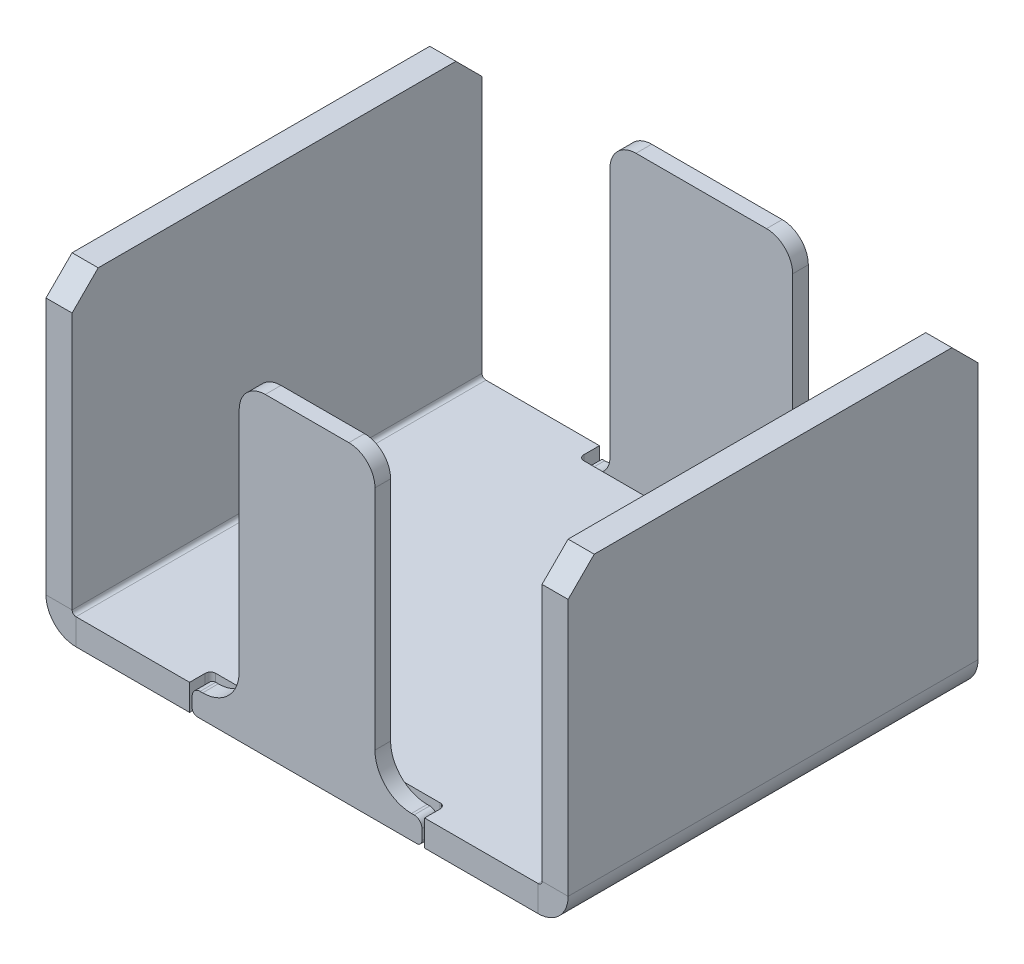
ISO-10303-21;
HEADER;
FILE_DESCRIPTION(('STEP AP214'),'2;1');
FILE_NAME('part.step','',(''),(''),'','','');
FILE_SCHEMA(('AUTOMOTIVE_DESIGN { 1 0 10303 214 1 1 1 1 }'));
ENDSEC;
DATA;
#1=APPLICATION_CONTEXT('core data for automotive mechanical design processes');
#2=APPLICATION_PROTOCOL_DEFINITION('international standard','automotive_design',2000,#1);
#3=PRODUCT_CONTEXT('',#1,'mechanical');
#4=PRODUCT('Part','Part','',(#3));
#5=PRODUCT_RELATED_PRODUCT_CATEGORY('part','',(#4));
#6=PRODUCT_DEFINITION_FORMATION('','',#4);
#7=PRODUCT_DEFINITION_CONTEXT('part definition',#1,'design');
#8=PRODUCT_DEFINITION('design','',#6,#7);
#9=PRODUCT_DEFINITION_SHAPE('','',#8);
#10=(LENGTH_UNIT() NAMED_UNIT(*) SI_UNIT(.MILLI.,.METRE.));
#11=(NAMED_UNIT(*) PLANE_ANGLE_UNIT() SI_UNIT($,.RADIAN.));
#12=(NAMED_UNIT(*) SI_UNIT($,.STERADIAN.) SOLID_ANGLE_UNIT());
#13=UNCERTAINTY_MEASURE_WITH_UNIT(LENGTH_MEASURE(1.E-05),#10,'distance_accuracy_value','');
#14=(GEOMETRIC_REPRESENTATION_CONTEXT(3) GLOBAL_UNCERTAINTY_ASSIGNED_CONTEXT((#13)) GLOBAL_UNIT_ASSIGNED_CONTEXT((#10,
#11,#12)) REPRESENTATION_CONTEXT('',''));
#15=CARTESIAN_POINT('',(0.,0.,0.));
#16=DIRECTION('',(0.,0.,1.));
#17=DIRECTION('',(1.,0.,0.));
#18=AXIS2_PLACEMENT_3D('',#15,#16,#17);
#19=CARTESIAN_POINT('',(-144.618197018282,-112.523009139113,278.5));
#20=DIRECTION('',(0.,-1.,0.));
#21=DIRECTION('',(0.,0.,-1.));
#22=AXIS2_PLACEMENT_3D('',#19,#20,#21);
#23=PLANE('',#22);
#24=DIRECTION('',(0.,0.,-1.));
#25=VECTOR('',#24,1.);
#26=CARTESIAN_POINT('',(43.8818029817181,-112.523009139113,121.5));
#27=LINE('',#26,#25);
#28=CARTESIAN_POINT('',(43.8818029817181,-112.523009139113,121.5));
#29=VERTEX_POINT('',#28);
#30=CARTESIAN_POINT('',(43.8818029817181,-112.523009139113,278.5));
#31=VERTEX_POINT('',#30);
#32=EDGE_CURVE('P0_E257',#29,#31,#27,.F.);
#33=ORIENTED_EDGE('',*,*,#32,.F.);
#34=DIRECTION('',(1.,0.,0.));
#35=VECTOR('',#34,1.);
#36=CARTESIAN_POINT('',(-144.618197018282,-112.523009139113,121.5));
#37=LINE('',#36,#35);
#38=CARTESIAN_POINT('',(0.381802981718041,-112.523009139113,121.5));
#39=VERTEX_POINT('',#38);
#40=EDGE_CURVE('P0_E380',#29,#39,#37,.F.);
#41=ORIENTED_EDGE('',*,*,#40,.T.);
#42=DIRECTION('',(0.,0.,1.));
#43=VECTOR('',#42,1.);
#44=CARTESIAN_POINT('',(0.381802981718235,-112.523009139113,278.499999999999));
#45=LINE('',#44,#43);
#46=CARTESIAN_POINT('',(0.381802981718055,-112.523009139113,127.5));
#47=VERTEX_POINT('',#46);
#48=EDGE_CURVE('P0_E352',#39,#47,#45,.T.);
#49=ORIENTED_EDGE('',*,*,#48,.T.);
#50=CARTESIAN_POINT('',(-1.61819701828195,-112.523009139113,127.5));
#51=DIRECTION('',(0.,-1.,0.));
#52=DIRECTION('',(0.,0.,-1.));
#53=AXIS2_PLACEMENT_3D('',#50,#51,#52);
#54=CIRCLE('',#53,2.00000000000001);
#55=CARTESIAN_POINT('',(-1.61819701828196,-112.523009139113,129.5));
#56=VERTEX_POINT('',#55);
#57=EDGE_CURVE('P0_E355',#47,#56,#54,.T.);
#58=ORIENTED_EDGE('',*,*,#57,.T.);
#59=DIRECTION('',(-1.,0.,0.));
#60=VECTOR('',#59,1.);
#61=CARTESIAN_POINT('',(-144.618197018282,-112.523009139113,129.5));
#62=LINE('',#61,#60);
#63=CARTESIAN_POINT('',(-87.618197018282,-112.523009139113,129.5));
#64=VERTEX_POINT('',#63);
#65=EDGE_CURVE('P0_E343',#56,#64,#62,.T.);
#66=ORIENTED_EDGE('',*,*,#65,.T.);
#67=CARTESIAN_POINT('',(-87.6181970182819,-112.523009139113,127.5));
#68=DIRECTION('',(0.,-1.,0.));
#69=DIRECTION('',(0.,0.,-1.));
#70=AXIS2_PLACEMENT_3D('',#67,#68,#69);
#71=CIRCLE('',#70,2.);
#72=CARTESIAN_POINT('',(-89.6181970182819,-112.523009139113,127.5));
#73=VERTEX_POINT('',#72);
#74=EDGE_CURVE('P0_E346',#64,#73,#71,.T.);
#75=ORIENTED_EDGE('',*,*,#74,.T.);
#76=DIRECTION('',(0.,0.,-1.));
#77=VECTOR('',#76,1.);
#78=CARTESIAN_POINT('',(-89.6181970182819,-112.523009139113,278.5));
#79=LINE('',#78,#77);
#80=CARTESIAN_POINT('',(-89.6181970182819,-112.523009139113,121.5));
#81=VERTEX_POINT('',#80);
#82=EDGE_CURVE('P0_E349',#73,#81,#79,.T.);
#83=ORIENTED_EDGE('',*,*,#82,.T.);
#84=CARTESIAN_POINT('',(-133.118197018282,-112.523009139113,121.5));
#85=VERTEX_POINT('',#84);
#86=EDGE_CURVE('P0_E372',#81,#85,#37,.F.);
#87=ORIENTED_EDGE('',*,*,#86,.T.);
#88=DIRECTION('',(0.,0.,1.));
#89=VECTOR('',#88,1.);
#90=CARTESIAN_POINT('',(-133.118197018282,-112.523009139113,278.5));
#91=LINE('',#90,#89);
#92=CARTESIAN_POINT('',(-133.118197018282,-112.523009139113,278.5));
#93=VERTEX_POINT('',#92);
#94=EDGE_CURVE('P0_E305',#93,#85,#91,.F.);
#95=ORIENTED_EDGE('',*,*,#94,.F.);
#96=DIRECTION('',(1.,0.,0.));
#97=VECTOR('',#96,1.);
#98=CARTESIAN_POINT('',(-144.618197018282,-112.523009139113,278.5));
#99=LINE('',#98,#97);
#100=CARTESIAN_POINT('',(-89.618197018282,-112.523009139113,278.5));
#101=VERTEX_POINT('',#100);
#102=EDGE_CURVE('P0_E376',#101,#93,#99,.F.);
#103=ORIENTED_EDGE('',*,*,#102,.F.);
#104=DIRECTION('',(0.,0.,-1.));
#105=VECTOR('',#104,1.);
#106=CARTESIAN_POINT('',(-89.618197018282,-112.523009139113,278.5));
#107=LINE('',#106,#105);
#108=CARTESIAN_POINT('',(-89.6181970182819,-112.523009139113,272.5));
#109=VERTEX_POINT('',#108);
#110=EDGE_CURVE('P0_E323',#101,#109,#107,.T.);
#111=ORIENTED_EDGE('',*,*,#110,.T.);
#112=CARTESIAN_POINT('',(-87.6181970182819,-112.523009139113,272.5));
#113=DIRECTION('',(0.,-1.,0.));
#114=DIRECTION('',(0.,0.,-1.));
#115=AXIS2_PLACEMENT_3D('',#112,#113,#114);
#116=CIRCLE('',#115,2.);
#117=CARTESIAN_POINT('',(-87.6181970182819,-112.523009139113,270.5));
#118=VERTEX_POINT('',#117);
#119=EDGE_CURVE('P0_E326',#109,#118,#116,.T.);
#120=ORIENTED_EDGE('',*,*,#119,.T.);
#121=DIRECTION('',(1.,0.,0.));
#122=VECTOR('',#121,1.);
#123=CARTESIAN_POINT('',(-144.618197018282,-112.523009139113,270.5));
#124=LINE('',#123,#122);
#125=CARTESIAN_POINT('',(-1.61819701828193,-112.523009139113,270.5));
#126=VERTEX_POINT('',#125);
#127=EDGE_CURVE('P0_E312',#118,#126,#124,.T.);
#128=ORIENTED_EDGE('',*,*,#127,.T.);
#129=CARTESIAN_POINT('',(-1.61819701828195,-112.523009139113,272.5));
#130=DIRECTION('',(0.,-1.,0.));
#131=DIRECTION('',(0.,0.,-1.));
#132=AXIS2_PLACEMENT_3D('',#129,#130,#131);
#133=CIRCLE('',#132,2.);
#134=CARTESIAN_POINT('',(0.381802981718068,-112.523009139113,272.5));
#135=VERTEX_POINT('',#134);
#136=EDGE_CURVE('P0_E317',#126,#135,#133,.T.);
#137=ORIENTED_EDGE('',*,*,#136,.T.);
#138=DIRECTION('',(0.,0.,1.));
#139=VECTOR('',#138,1.);
#140=CARTESIAN_POINT('',(0.381802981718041,-112.523009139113,278.5));
#141=LINE('',#140,#139);
#142=CARTESIAN_POINT('',(0.381802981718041,-112.523009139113,278.5));
#143=VERTEX_POINT('',#142);
#144=EDGE_CURVE('P0_E320',#135,#143,#141,.T.);
#145=ORIENTED_EDGE('',*,*,#144,.T.);
#146=EDGE_CURVE('P0_E373',#31,#143,#99,.F.);
#147=ORIENTED_EDGE('',*,*,#146,.F.);
#148=EDGE_LOOP('',(#33,#41,#49,#58,#66,#75,#83,#87,#95,#103,#111,#120,#128,#137,#145,#147));
#149=FACE_BOUND('',#148,.T.);
#150=ADVANCED_FACE('P0_F16',(#149),#23,.F.);
#151=CARTESIAN_POINT('',(-144.618197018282,-122.523009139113,278.5));
#152=DIRECTION('',(0.,-1.,0.));
#153=DIRECTION('',(0.,0.,-1.));
#154=AXIS2_PLACEMENT_3D('',#151,#152,#153);
#155=PLANE('',#154);
#156=DIRECTION('',(-1.,0.,0.));
#157=VECTOR('',#156,1.);
#158=CARTESIAN_POINT('',(-144.618197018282,-122.523009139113,121.5));
#159=LINE('',#158,#157);
#160=CARTESIAN_POINT('',(43.8818029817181,-122.523009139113,121.5));
#161=VERTEX_POINT('',#160);
#162=CARTESIAN_POINT('',(0.381802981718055,-122.523009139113,121.5));
#163=VERTEX_POINT('',#162);
#164=EDGE_CURVE('P0_E383',#161,#163,#159,.T.);
#165=ORIENTED_EDGE('',*,*,#164,.F.);
#166=DIRECTION('',(0.,0.,-1.));
#167=VECTOR('',#166,1.);
#168=CARTESIAN_POINT('',(43.8818029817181,-122.523009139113,121.5));
#169=LINE('',#168,#167);
#170=CARTESIAN_POINT('',(43.8818029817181,-122.523009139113,278.5));
#171=VERTEX_POINT('',#170);
#172=EDGE_CURVE('P0_E208',#161,#171,#169,.F.);
#173=ORIENTED_EDGE('',*,*,#172,.T.);
#174=DIRECTION('',(-1.,0.,0.));
#175=VECTOR('',#174,1.);
#176=CARTESIAN_POINT('',(-144.618197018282,-122.523009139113,278.5));
#177=LINE('',#176,#175);
#178=CARTESIAN_POINT('',(0.381802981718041,-122.523009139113,278.5));
#179=VERTEX_POINT('',#178);
#180=EDGE_CURVE('P0_E377',#171,#179,#177,.T.);
#181=ORIENTED_EDGE('',*,*,#180,.T.);
#182=DIRECTION('',(0.,0.,-1.));
#183=VECTOR('',#182,1.);
#184=CARTESIAN_POINT('',(0.381802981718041,-122.523009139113,278.5));
#185=LINE('',#184,#183);
#186=CARTESIAN_POINT('',(0.381802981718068,-122.523009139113,272.5));
#187=VERTEX_POINT('',#186);
#188=EDGE_CURVE('P0_E340',#179,#187,#185,.T.);
#189=ORIENTED_EDGE('',*,*,#188,.T.);
#190=CARTESIAN_POINT('',(-1.61819701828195,-122.523009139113,272.5));
#191=DIRECTION('',(0.,-1.,0.));
#192=DIRECTION('',(0.,0.,-1.));
#193=AXIS2_PLACEMENT_3D('',#190,#191,#192);
#194=CIRCLE('',#193,2.);
#195=CARTESIAN_POINT('',(-1.61819701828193,-122.523009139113,270.5));
#196=VERTEX_POINT('',#195);
#197=EDGE_CURVE('P0_E410',#187,#196,#194,.F.);
#198=ORIENTED_EDGE('',*,*,#197,.T.);
#199=DIRECTION('',(-1.,0.,0.));
#200=VECTOR('',#199,1.);
#201=CARTESIAN_POINT('',(-144.618197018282,-122.523009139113,270.5));
#202=LINE('',#201,#200);
#203=CARTESIAN_POINT('',(-87.6181970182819,-122.523009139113,270.5));
#204=VERTEX_POINT('',#203);
#205=EDGE_CURVE('P0_E407',#196,#204,#202,.T.);
#206=ORIENTED_EDGE('',*,*,#205,.T.);
#207=CARTESIAN_POINT('',(-87.6181970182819,-122.523009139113,272.5));
#208=DIRECTION('',(0.,-1.,0.));
#209=DIRECTION('',(0.,0.,-1.));
#210=AXIS2_PLACEMENT_3D('',#207,#208,#209);
#211=CIRCLE('',#210,2.);
#212=CARTESIAN_POINT('',(-89.6181970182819,-122.523009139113,272.5));
#213=VERTEX_POINT('',#212);
#214=EDGE_CURVE('P0_E404',#204,#213,#211,.F.);
#215=ORIENTED_EDGE('',*,*,#214,.T.);
#216=DIRECTION('',(0.,0.,1.));
#217=VECTOR('',#216,1.);
#218=CARTESIAN_POINT('',(-89.618197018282,-122.523009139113,278.5));
#219=LINE('',#218,#217);
#220=CARTESIAN_POINT('',(-89.618197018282,-122.523009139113,278.5));
#221=VERTEX_POINT('',#220);
#222=EDGE_CURVE('P0_E337',#213,#221,#219,.T.);
#223=ORIENTED_EDGE('',*,*,#222,.T.);
#224=CARTESIAN_POINT('',(-133.118197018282,-122.523009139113,278.5));
#225=VERTEX_POINT('',#224);
#226=EDGE_CURVE('P0_E375',#221,#225,#177,.T.);
#227=ORIENTED_EDGE('',*,*,#226,.T.);
#228=DIRECTION('',(0.,0.,1.));
#229=VECTOR('',#228,1.);
#230=CARTESIAN_POINT('',(-133.118197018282,-122.523009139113,278.5));
#231=LINE('',#230,#229);
#232=CARTESIAN_POINT('',(-133.118197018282,-122.523009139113,121.5));
#233=VERTEX_POINT('',#232);
#234=EDGE_CURVE('P0_E292',#225,#233,#231,.F.);
#235=ORIENTED_EDGE('',*,*,#234,.T.);
#236=CARTESIAN_POINT('',(-89.6181970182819,-122.523009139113,121.5));
#237=VERTEX_POINT('',#236);
#238=EDGE_CURVE('P0_E382',#237,#233,#159,.T.);
#239=ORIENTED_EDGE('',*,*,#238,.F.);
#240=DIRECTION('',(0.,0.,1.));
#241=VECTOR('',#240,1.);
#242=CARTESIAN_POINT('',(-89.6181970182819,-122.523009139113,278.5));
#243=LINE('',#242,#241);
#244=CARTESIAN_POINT('',(-89.6181970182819,-122.523009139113,127.5));
#245=VERTEX_POINT('',#244);
#246=EDGE_CURVE('P0_E369',#237,#245,#243,.T.);
#247=ORIENTED_EDGE('',*,*,#246,.T.);
#248=CARTESIAN_POINT('',(-87.6181970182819,-122.523009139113,127.5));
#249=DIRECTION('',(0.,-1.,0.));
#250=DIRECTION('',(0.,0.,-1.));
#251=AXIS2_PLACEMENT_3D('',#248,#249,#250);
#252=CIRCLE('',#251,2.);
#253=CARTESIAN_POINT('',(-87.618197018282,-122.523009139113,129.5));
#254=VERTEX_POINT('',#253);
#255=EDGE_CURVE('P0_E395',#245,#254,#252,.F.);
#256=ORIENTED_EDGE('',*,*,#255,.T.);
#257=DIRECTION('',(1.,0.,0.));
#258=VECTOR('',#257,1.);
#259=CARTESIAN_POINT('',(-144.618197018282,-122.523009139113,129.5));
#260=LINE('',#259,#258);
#261=CARTESIAN_POINT('',(-1.61819701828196,-122.523009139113,129.5));
#262=VERTEX_POINT('',#261);
#263=EDGE_CURVE('P0_E392',#254,#262,#260,.T.);
#264=ORIENTED_EDGE('',*,*,#263,.T.);
#265=CARTESIAN_POINT('',(-1.61819701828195,-122.523009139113,127.5));
#266=DIRECTION('',(0.,-1.,0.));
#267=DIRECTION('',(0.,0.,-1.));
#268=AXIS2_PLACEMENT_3D('',#265,#266,#267);
#269=CIRCLE('',#268,2.00000000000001);
#270=CARTESIAN_POINT('',(0.381802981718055,-122.523009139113,127.5));
#271=VERTEX_POINT('',#270);
#272=EDGE_CURVE('P0_E389',#262,#271,#269,.F.);
#273=ORIENTED_EDGE('',*,*,#272,.T.);
#274=DIRECTION('',(0.,0.,-1.));
#275=VECTOR('',#274,1.);
#276=CARTESIAN_POINT('',(0.381802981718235,-122.523009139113,278.499999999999));
#277=LINE('',#276,#275);
#278=EDGE_CURVE('P0_E366',#271,#163,#277,.T.);
#279=ORIENTED_EDGE('',*,*,#278,.T.);
#280=EDGE_LOOP('',(#165,#173,#181,#189,#198,#206,#215,#223,#227,#235,#239,#247,#256,#264,#273,#279));
#281=FACE_BOUND('',#280,.T.);
#282=ADVANCED_FACE('P0_F472',(#281),#155,.T.);
#283=CARTESIAN_POINT('',(-44.6181970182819,-62.5230091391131,121.5));
#284=DIRECTION('',(0.,0.,1.));
#285=DIRECTION('',(1.,0.,0.));
#286=AXIS2_PLACEMENT_3D('',#283,#284,#285);
#287=PLANE('',#286);
#288=DIRECTION('',(0.,-1.,0.));
#289=VECTOR('',#288,1.);
#290=CARTESIAN_POINT('',(43.8818029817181,-112.523009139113,121.5));
#291=LINE('',#290,#289);
#292=EDGE_CURVE('P0_E253',#29,#161,#291,.T.);
#293=ORIENTED_EDGE('',*,*,#292,.T.);
#294=ORIENTED_EDGE('',*,*,#164,.T.);
#295=DIRECTION('',(0.,-1.,0.));
#296=VECTOR('',#295,1.);
#297=CARTESIAN_POINT('',(0.381802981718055,-62.5230091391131,121.5));
#298=LINE('',#297,#296);
#299=EDGE_CURVE('P0_E379',#39,#163,#298,.T.);
#300=ORIENTED_EDGE('',*,*,#299,.F.);
#301=ORIENTED_EDGE('',*,*,#40,.F.);
#302=EDGE_LOOP('',(#293,#294,#300,#301));
#303=FACE_BOUND('',#302,.T.);
#304=ADVANCED_FACE('P0_F475',(#303),#287,.F.);
#305=CARTESIAN_POINT('',(-44.6181970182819,-62.5230091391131,278.5));
#306=DIRECTION('',(0.,0.,1.));
#307=DIRECTION('',(1.,0.,0.));
#308=AXIS2_PLACEMENT_3D('',#305,#306,#307);
#309=PLANE('',#308);
#310=ORIENTED_EDGE('',*,*,#102,.T.);
#311=DIRECTION('',(0.,-1.,0.));
#312=VECTOR('',#311,1.);
#313=CARTESIAN_POINT('',(-133.118197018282,-112.523009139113,278.5));
#314=LINE('',#313,#312);
#315=EDGE_CURVE('P0_E299',#93,#225,#314,.T.);
#316=ORIENTED_EDGE('',*,*,#315,.T.);
#317=ORIENTED_EDGE('',*,*,#226,.F.);
#318=DIRECTION('',(0.,1.,0.));
#319=VECTOR('',#318,1.);
#320=CARTESIAN_POINT('',(-89.618197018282,-62.5230091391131,278.5));
#321=LINE('',#320,#319);
#322=EDGE_CURVE('P0_E398',#221,#101,#321,.T.);
#323=ORIENTED_EDGE('',*,*,#322,.T.);
#324=EDGE_LOOP('',(#310,#316,#317,#323));
#325=FACE_BOUND('',#324,.T.);
#326=ADVANCED_FACE('P0_F518',(#325),#309,.T.);
#327=DIRECTION('',(0.,-1.,0.));
#328=VECTOR('',#327,1.);
#329=CARTESIAN_POINT('',(-133.118197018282,-112.523009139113,121.5));
#330=LINE('',#329,#328);
#331=EDGE_CURVE('P0_E309',#85,#233,#330,.T.);
#332=ORIENTED_EDGE('',*,*,#331,.F.);
#333=ORIENTED_EDGE('',*,*,#86,.F.);
#334=DIRECTION('',(0.,1.,0.));
#335=VECTOR('',#334,1.);
#336=CARTESIAN_POINT('',(-89.6181970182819,-62.5230091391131,121.5));
#337=LINE('',#336,#335);
#338=EDGE_CURVE('P0_E387',#237,#81,#337,.T.);
#339=ORIENTED_EDGE('',*,*,#338,.F.);
#340=ORIENTED_EDGE('',*,*,#238,.T.);
#341=EDGE_LOOP('',(#332,#333,#339,#340));
#342=FACE_BOUND('',#341,.T.);
#343=ADVANCED_FACE('P0_F500',(#342),#287,.F.);
#344=DIRECTION('',(0.,-1.,0.));
#345=VECTOR('',#344,1.);
#346=CARTESIAN_POINT('',(43.8818029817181,-112.523009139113,278.5));
#347=LINE('',#346,#345);
#348=EDGE_CURVE('P0_E260',#31,#171,#347,.T.);
#349=ORIENTED_EDGE('',*,*,#348,.F.);
#350=ORIENTED_EDGE('',*,*,#146,.T.);
#351=DIRECTION('',(0.,-1.,0.));
#352=VECTOR('',#351,1.);
#353=CARTESIAN_POINT('',(0.381802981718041,-62.5230091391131,278.5));
#354=LINE('',#353,#352);
#355=EDGE_CURVE('P0_E401',#143,#179,#354,.T.);
#356=ORIENTED_EDGE('',*,*,#355,.T.);
#357=ORIENTED_EDGE('',*,*,#180,.F.);
#358=EDGE_LOOP('',(#349,#350,#356,#357));
#359=FACE_BOUND('',#358,.T.);
#360=ADVANCED_FACE('P0_F461',(#359),#309,.T.);
#361=CARTESIAN_POINT('',(-144.618197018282,-192.523009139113,129.5));
#362=DIRECTION('',(0.,0.,-1.));
#363=DIRECTION('',(-1.,0.,0.));
#364=AXIS2_PLACEMENT_3D('',#361,#362,#363);
#365=PLANE('',#364);
#366=DIRECTION('',(0.,1.,0.));
#367=VECTOR('',#366,1.);
#368=CARTESIAN_POINT('',(-87.618197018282,-192.523009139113,129.5));
#369=LINE('',#368,#367);
#370=EDGE_CURVE('P0_E364',#254,#64,#369,.T.);
#371=ORIENTED_EDGE('',*,*,#370,.T.);
#372=ORIENTED_EDGE('',*,*,#65,.F.);
#373=DIRECTION('',(0.,1.,0.));
#374=VECTOR('',#373,1.);
#375=CARTESIAN_POINT('',(-1.61819701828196,-192.523009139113,129.5));
#376=LINE('',#375,#374);
#377=EDGE_CURVE('P0_E358',#262,#56,#376,.T.);
#378=ORIENTED_EDGE('',*,*,#377,.F.);
#379=ORIENTED_EDGE('',*,*,#263,.F.);
#380=EDGE_LOOP('',(#371,#372,#378,#379));
#381=FACE_BOUND('',#380,.T.);
#382=ADVANCED_FACE('P0_F486',(#381),#365,.T.);
#383=CARTESIAN_POINT('',(-87.6181970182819,-192.523009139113,127.5));
#384=DIRECTION('',(0.,1.,0.));
#385=DIRECTION('',(0.,0.,1.));
#386=AXIS2_PLACEMENT_3D('',#383,#384,#385);
#387=CYLINDRICAL_SURFACE('',#386,2.);
#388=DIRECTION('',(0.,1.,0.));
#389=VECTOR('',#388,1.);
#390=CARTESIAN_POINT('',(-89.6181970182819,-192.523009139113,127.5));
#391=LINE('',#390,#389);
#392=EDGE_CURVE('P0_E362',#245,#73,#391,.T.);
#393=ORIENTED_EDGE('',*,*,#392,.T.);
#394=ORIENTED_EDGE('',*,*,#74,.F.);
#395=ORIENTED_EDGE('',*,*,#370,.F.);
#396=ORIENTED_EDGE('',*,*,#255,.F.);
#397=EDGE_LOOP('',(#393,#394,#395,#396));
#398=FACE_BOUND('',#397,.T.);
#399=ADVANCED_FACE('P0_F490',(#398),#387,.F.);
#400=CARTESIAN_POINT('',(-89.6181970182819,-192.523009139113,278.5));
#401=DIRECTION('',(1.,0.,0.));
#402=DIRECTION('',(0.,0.,-1.));
#403=AXIS2_PLACEMENT_3D('',#400,#401,#402);
#404=PLANE('',#403);
#405=ORIENTED_EDGE('',*,*,#338,.T.);
#406=ORIENTED_EDGE('',*,*,#82,.F.);
#407=ORIENTED_EDGE('',*,*,#392,.F.);
#408=ORIENTED_EDGE('',*,*,#246,.F.);
#409=EDGE_LOOP('',(#405,#406,#407,#408));
#410=FACE_BOUND('',#409,.T.);
#411=ADVANCED_FACE('P0_F633',(#410),#404,.T.);
#412=CARTESIAN_POINT('',(0.381802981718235,-192.523009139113,278.499999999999));
#413=DIRECTION('',(-1.,0.,0.));
#414=DIRECTION('',(0.,0.,1.));
#415=AXIS2_PLACEMENT_3D('',#412,#413,#414);
#416=PLANE('',#415);
#417=DIRECTION('',(0.,1.,0.));
#418=VECTOR('',#417,1.);
#419=CARTESIAN_POINT('',(0.381802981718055,-192.523009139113,127.5));
#420=LINE('',#419,#418);
#421=EDGE_CURVE('P0_E360',#271,#47,#420,.T.);
#422=ORIENTED_EDGE('',*,*,#421,.T.);
#423=ORIENTED_EDGE('',*,*,#48,.F.);
#424=ORIENTED_EDGE('',*,*,#299,.T.);
#425=ORIENTED_EDGE('',*,*,#278,.F.);
#426=EDGE_LOOP('',(#422,#423,#424,#425));
#427=FACE_BOUND('',#426,.T.);
#428=ADVANCED_FACE('P0_F478',(#427),#416,.T.);
#429=CARTESIAN_POINT('',(-1.61819701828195,-192.523009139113,127.5));
#430=DIRECTION('',(0.,1.,0.));
#431=DIRECTION('',(0.,0.,1.));
#432=AXIS2_PLACEMENT_3D('',#429,#430,#431);
#433=CYLINDRICAL_SURFACE('',#432,2.00000000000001);
#434=ORIENTED_EDGE('',*,*,#377,.T.);
#435=ORIENTED_EDGE('',*,*,#57,.F.);
#436=ORIENTED_EDGE('',*,*,#421,.F.);
#437=ORIENTED_EDGE('',*,*,#272,.F.);
#438=EDGE_LOOP('',(#434,#435,#436,#437));
#439=FACE_BOUND('',#438,.T.);
#440=ADVANCED_FACE('P0_F483',(#439),#433,.F.);
#441=CARTESIAN_POINT('',(-144.618197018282,-192.523009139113,270.5));
#442=DIRECTION('',(0.,0.,1.));
#443=DIRECTION('',(1.,0.,0.));
#444=AXIS2_PLACEMENT_3D('',#441,#442,#443);
#445=PLANE('',#444);
#446=DIRECTION('',(0.,1.,0.));
#447=VECTOR('',#446,1.);
#448=CARTESIAN_POINT('',(-1.61819701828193,-192.523009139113,270.5));
#449=LINE('',#448,#447);
#450=EDGE_CURVE('P0_E335',#196,#126,#449,.T.);
#451=ORIENTED_EDGE('',*,*,#450,.T.);
#452=ORIENTED_EDGE('',*,*,#127,.F.);
#453=DIRECTION('',(0.,1.,0.));
#454=VECTOR('',#453,1.);
#455=CARTESIAN_POINT('',(-87.6181970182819,-192.523009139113,270.5));
#456=LINE('',#455,#454);
#457=EDGE_CURVE('P0_E329',#204,#118,#456,.T.);
#458=ORIENTED_EDGE('',*,*,#457,.F.);
#459=ORIENTED_EDGE('',*,*,#205,.F.);
#460=EDGE_LOOP('',(#451,#452,#458,#459));
#461=FACE_BOUND('',#460,.T.);
#462=ADVANCED_FACE('P0_F624',(#461),#445,.T.);
#463=CARTESIAN_POINT('',(-1.61819701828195,-192.523009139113,272.5));
#464=DIRECTION('',(0.,1.,0.));
#465=DIRECTION('',(0.,0.,1.));
#466=AXIS2_PLACEMENT_3D('',#463,#464,#465);
#467=CYLINDRICAL_SURFACE('',#466,2.);
#468=DIRECTION('',(0.,1.,0.));
#469=VECTOR('',#468,1.);
#470=CARTESIAN_POINT('',(0.381802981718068,-192.523009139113,272.5));
#471=LINE('',#470,#469);
#472=EDGE_CURVE('P0_E333',#187,#135,#471,.T.);
#473=ORIENTED_EDGE('',*,*,#472,.T.);
#474=ORIENTED_EDGE('',*,*,#136,.F.);
#475=ORIENTED_EDGE('',*,*,#450,.F.);
#476=ORIENTED_EDGE('',*,*,#197,.F.);
#477=EDGE_LOOP('',(#473,#474,#475,#476));
#478=FACE_BOUND('',#477,.T.);
#479=ADVANCED_FACE('P0_F621',(#478),#467,.F.);
#480=CARTESIAN_POINT('',(0.381802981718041,-192.523009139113,278.5));
#481=DIRECTION('',(-1.,0.,0.));
#482=DIRECTION('',(0.,0.,1.));
#483=AXIS2_PLACEMENT_3D('',#480,#481,#482);
#484=PLANE('',#483);
#485=ORIENTED_EDGE('',*,*,#355,.F.);
#486=ORIENTED_EDGE('',*,*,#144,.F.);
#487=ORIENTED_EDGE('',*,*,#472,.F.);
#488=ORIENTED_EDGE('',*,*,#188,.F.);
#489=EDGE_LOOP('',(#485,#486,#487,#488));
#490=FACE_BOUND('',#489,.T.);
#491=ADVANCED_FACE('P0_F468',(#490),#484,.T.);
#492=CARTESIAN_POINT('',(-89.618197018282,-192.523009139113,278.5));
#493=DIRECTION('',(1.,0.,0.));
#494=DIRECTION('',(0.,0.,-1.));
#495=AXIS2_PLACEMENT_3D('',#492,#493,#494);
#496=PLANE('',#495);
#497=DIRECTION('',(0.,1.,0.));
#498=VECTOR('',#497,1.);
#499=CARTESIAN_POINT('',(-89.6181970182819,-192.523009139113,272.5));
#500=LINE('',#499,#498);
#501=EDGE_CURVE('P0_E331',#213,#109,#500,.T.);
#502=ORIENTED_EDGE('',*,*,#501,.T.);
#503=ORIENTED_EDGE('',*,*,#110,.F.);
#504=ORIENTED_EDGE('',*,*,#322,.F.);
#505=ORIENTED_EDGE('',*,*,#222,.F.);
#506=EDGE_LOOP('',(#502,#503,#504,#505));
#507=FACE_BOUND('',#506,.T.);
#508=ADVANCED_FACE('P0_F614',(#507),#496,.T.);
#509=CARTESIAN_POINT('',(-87.6181970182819,-192.523009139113,272.5));
#510=DIRECTION('',(0.,1.,0.));
#511=DIRECTION('',(0.,0.,1.));
#512=AXIS2_PLACEMENT_3D('',#509,#510,#511);
#513=CYLINDRICAL_SURFACE('',#512,2.);
#514=ORIENTED_EDGE('',*,*,#457,.T.);
#515=ORIENTED_EDGE('',*,*,#119,.F.);
#516=ORIENTED_EDGE('',*,*,#501,.F.);
#517=ORIENTED_EDGE('',*,*,#214,.F.);
#518=EDGE_LOOP('',(#514,#515,#516,#517));
#519=FACE_BOUND('',#518,.T.);
#520=ADVANCED_FACE('P0_F609',(#519),#513,.F.);
#521=CARTESIAN_POINT('',(-133.118197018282,-111.023009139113,121.5));
#522=DIRECTION('',(0.,0.,-1.));
#523=DIRECTION('',(-1.,0.,0.));
#524=AXIS2_PLACEMENT_3D('',#521,#522,#523);
#525=PLANE('',#524);
#526=DIRECTION('',(1.,0.,0.));
#527=VECTOR('',#526,1.);
#528=CARTESIAN_POINT('',(-144.618197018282,-111.023009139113,121.5));
#529=LINE('',#528,#527);
#530=CARTESIAN_POINT('',(-134.618197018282,-111.023009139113,121.5));
#531=VERTEX_POINT('',#530);
#532=CARTESIAN_POINT('',(-144.618197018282,-111.023009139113,121.5));
#533=VERTEX_POINT('',#532);
#534=EDGE_CURVE('P0_E263',#531,#533,#529,.F.);
#535=ORIENTED_EDGE('',*,*,#534,.F.);
#536=CARTESIAN_POINT('',(-133.118197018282,-111.023009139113,121.5));
#537=DIRECTION('',(0.,0.,1.));
#538=DIRECTION('',(1.,0.,0.));
#539=AXIS2_PLACEMENT_3D('',#536,#537,#538);
#540=CIRCLE('',#539,1.5);
#541=EDGE_CURVE('P0_E302',#85,#531,#540,.F.);
#542=ORIENTED_EDGE('',*,*,#541,.F.);
#543=ORIENTED_EDGE('',*,*,#331,.T.);
#544=CARTESIAN_POINT('',(-133.118197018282,-111.023009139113,121.5));
#545=DIRECTION('',(0.,0.,1.));
#546=DIRECTION('',(1.,0.,0.));
#547=AXIS2_PLACEMENT_3D('',#544,#545,#546);
#548=CIRCLE('',#547,11.5);
#549=EDGE_CURVE('P0_E295',#233,#533,#548,.F.);
#550=ORIENTED_EDGE('',*,*,#549,.T.);
#551=EDGE_LOOP('',(#535,#542,#543,#550));
#552=FACE_BOUND('',#551,.T.);
#553=ADVANCED_FACE('P0_F506',(#552),#525,.T.);
#554=CARTESIAN_POINT('',(-133.118197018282,-111.023009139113,278.5));
#555=DIRECTION('',(0.,0.,-1.));
#556=DIRECTION('',(-1.,0.,0.));
#557=AXIS2_PLACEMENT_3D('',#554,#555,#556);
#558=PLANE('',#557);
#559=CARTESIAN_POINT('',(-133.118197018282,-111.023009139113,278.5));
#560=DIRECTION('',(0.,0.,1.));
#561=DIRECTION('',(1.,0.,0.));
#562=AXIS2_PLACEMENT_3D('',#559,#560,#561);
#563=CIRCLE('',#562,1.5);
#564=CARTESIAN_POINT('',(-134.618197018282,-111.023009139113,278.5));
#565=VERTEX_POINT('',#564);
#566=EDGE_CURVE('P0_E267',#565,#93,#563,.T.);
#567=ORIENTED_EDGE('',*,*,#566,.F.);
#568=DIRECTION('',(1.,0.,0.));
#569=VECTOR('',#568,1.);
#570=CARTESIAN_POINT('',(-134.618197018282,-111.023009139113,278.5));
#571=LINE('',#570,#569);
#572=CARTESIAN_POINT('',(-144.618197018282,-111.023009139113,278.5));
#573=VERTEX_POINT('',#572);
#574=EDGE_CURVE('P0_E285',#565,#573,#571,.F.);
#575=ORIENTED_EDGE('',*,*,#574,.T.);
#576=CARTESIAN_POINT('',(-133.118197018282,-111.023009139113,278.5));
#577=DIRECTION('',(0.,0.,1.));
#578=DIRECTION('',(1.,0.,0.));
#579=AXIS2_PLACEMENT_3D('',#576,#577,#578);
#580=CIRCLE('',#579,11.5);
#581=EDGE_CURVE('P0_E296',#573,#225,#580,.T.);
#582=ORIENTED_EDGE('',*,*,#581,.T.);
#583=ORIENTED_EDGE('',*,*,#315,.F.);
#584=EDGE_LOOP('',(#567,#575,#582,#583));
#585=FACE_BOUND('',#584,.T.);
#586=ADVANCED_FACE('P0_F513',(#585),#558,.F.);
#587=CARTESIAN_POINT('',(-133.118197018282,-111.023009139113,278.5));
#588=DIRECTION('',(0.,0.,1.));
#589=DIRECTION('',(-1.,0.,0.));
#590=AXIS2_PLACEMENT_3D('',#587,#588,#589);
#591=CYLINDRICAL_SURFACE('',#590,11.5);
#592=ORIENTED_EDGE('',*,*,#234,.F.);
#593=ORIENTED_EDGE('',*,*,#581,.F.);
#594=DIRECTION('',(0.,0.,1.));
#595=VECTOR('',#594,1.);
#596=CARTESIAN_POINT('',(-144.618197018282,-111.023009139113,121.5));
#597=LINE('',#596,#595);
#598=EDGE_CURVE('P0_E282',#573,#533,#597,.F.);
#599=ORIENTED_EDGE('',*,*,#598,.T.);
#600=ORIENTED_EDGE('',*,*,#549,.F.);
#601=EDGE_LOOP('',(#592,#593,#599,#600));
#602=FACE_BOUND('',#601,.T.);
#603=ADVANCED_FACE('P0_F510',(#602),#591,.T.);
#604=CARTESIAN_POINT('',(-133.118197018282,-111.023009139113,278.5));
#605=DIRECTION('',(0.,0.,1.));
#606=DIRECTION('',(-1.,0.,0.));
#607=AXIS2_PLACEMENT_3D('',#604,#605,#606);
#608=CYLINDRICAL_SURFACE('',#607,1.5);
#609=ORIENTED_EDGE('',*,*,#94,.T.);
#610=ORIENTED_EDGE('',*,*,#541,.T.);
#611=DIRECTION('',(0.,0.,1.));
#612=VECTOR('',#611,1.);
#613=CARTESIAN_POINT('',(-134.618197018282,-111.023009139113,121.5));
#614=LINE('',#613,#612);
#615=EDGE_CURVE('P0_E288',#531,#565,#614,.T.);
#616=ORIENTED_EDGE('',*,*,#615,.T.);
#617=ORIENTED_EDGE('',*,*,#566,.T.);
#618=EDGE_LOOP('',(#609,#610,#616,#617));
#619=FACE_BOUND('',#618,.T.);
#620=ADVANCED_FACE('P0_F521',(#619),#608,.F.);
#621=CARTESIAN_POINT('',(-144.618197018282,-2.52300913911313,278.5));
#622=DIRECTION('',(0.,0.,-1.));
#623=DIRECTION('',(-1.,0.,0.));
#624=AXIS2_PLACEMENT_3D('',#621,#622,#623);
#625=PLANE('',#624);
#626=DIRECTION('',(0.,-1.,0.));
#627=VECTOR('',#626,1.);
#628=CARTESIAN_POINT('',(-134.618197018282,-2.5230091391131,278.5));
#629=LINE('',#628,#627);
#630=CARTESIAN_POINT('',(-134.618197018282,-12.5230091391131,278.5));
#631=VERTEX_POINT('',#630);
#632=EDGE_CURVE('P0_E279',#565,#631,#629,.F.);
#633=ORIENTED_EDGE('',*,*,#632,.T.);
#634=DIRECTION('',(-1.,0.,0.));
#635=VECTOR('',#634,1.);
#636=CARTESIAN_POINT('',(-144.618197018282,-12.5230091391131,278.5));
#637=LINE('',#636,#635);
#638=CARTESIAN_POINT('',(-144.618197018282,-12.5230091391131,278.5));
#639=VERTEX_POINT('',#638);
#640=EDGE_CURVE('P0_E418',#631,#639,#637,.T.);
#641=ORIENTED_EDGE('',*,*,#640,.T.);
#642=DIRECTION('',(0.,1.,0.));
#643=VECTOR('',#642,1.);
#644=CARTESIAN_POINT('',(-144.618197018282,-62.5230091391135,278.5));
#645=LINE('',#644,#643);
#646=EDGE_CURVE('P0_E271',#573,#639,#645,.T.);
#647=ORIENTED_EDGE('',*,*,#646,.F.);
#648=ORIENTED_EDGE('',*,*,#574,.F.);
#649=EDGE_LOOP('',(#633,#641,#647,#648));
#650=FACE_BOUND('',#649,.T.);
#651=ADVANCED_FACE('P0_F526',(#650),#625,.F.);
#652=CARTESIAN_POINT('',(-144.618197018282,-112.523009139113,121.5));
#653=DIRECTION('',(0.,0.,1.));
#654=DIRECTION('',(1.,0.,0.));
#655=AXIS2_PLACEMENT_3D('',#652,#653,#654);
#656=PLANE('',#655);
#657=DIRECTION('',(0.,-1.,0.));
#658=VECTOR('',#657,1.);
#659=CARTESIAN_POINT('',(-144.618197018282,-62.5230091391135,121.5));
#660=LINE('',#659,#658);
#661=CARTESIAN_POINT('',(-144.618197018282,-12.5230091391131,121.5));
#662=VERTEX_POINT('',#661);
#663=EDGE_CURVE('P0_E265',#662,#533,#660,.T.);
#664=ORIENTED_EDGE('',*,*,#663,.F.);
#665=DIRECTION('',(1.,0.,0.));
#666=VECTOR('',#665,1.);
#667=CARTESIAN_POINT('',(-144.618197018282,-12.5230091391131,121.5));
#668=LINE('',#667,#666);
#669=CARTESIAN_POINT('',(-134.618197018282,-12.5230091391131,121.5));
#670=VERTEX_POINT('',#669);
#671=EDGE_CURVE('P0_E422',#662,#670,#668,.T.);
#672=ORIENTED_EDGE('',*,*,#671,.T.);
#673=DIRECTION('',(0.,1.,0.));
#674=VECTOR('',#673,1.);
#675=CARTESIAN_POINT('',(-134.618197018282,-112.523009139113,121.5));
#676=LINE('',#675,#674);
#677=EDGE_CURVE('P0_E274',#670,#531,#676,.F.);
#678=ORIENTED_EDGE('',*,*,#677,.T.);
#679=ORIENTED_EDGE('',*,*,#534,.T.);
#680=EDGE_LOOP('',(#664,#672,#678,#679));
#681=FACE_BOUND('',#680,.T.);
#682=ADVANCED_FACE('P0_F548',(#681),#656,.F.);
#683=CARTESIAN_POINT('',(-144.618197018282,-62.5230091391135,121.5));
#684=DIRECTION('',(1.,0.,0.));
#685=DIRECTION('',(0.,1.,0.));
#686=AXIS2_PLACEMENT_3D('',#683,#684,#685);
#687=PLANE('',#686);
#688=DIRECTION('',(0.,0.,-1.));
#689=VECTOR('',#688,1.);
#690=CARTESIAN_POINT('',(-144.618197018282,-2.52300913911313,121.5));
#691=LINE('',#690,#689);
#692=CARTESIAN_POINT('',(-144.618197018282,-2.52300913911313,268.5));
#693=VERTEX_POINT('',#692);
#694=CARTESIAN_POINT('',(-144.618197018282,-2.52300913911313,131.5));
#695=VERTEX_POINT('',#694);
#696=EDGE_CURVE('P0_E268',#693,#695,#691,.T.);
#697=ORIENTED_EDGE('',*,*,#696,.T.);
#698=DIRECTION('',(0.,0.707106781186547,0.707106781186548));
#699=VECTOR('',#698,1.);
#700=CARTESIAN_POINT('',(-144.618197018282,-12.5230091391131,121.5));
#701=LINE('',#700,#699);
#702=EDGE_CURVE('P0_E429',#695,#662,#701,.F.);
#703=ORIENTED_EDGE('',*,*,#702,.T.);
#704=ORIENTED_EDGE('',*,*,#663,.T.);
#705=ORIENTED_EDGE('',*,*,#598,.F.);
#706=ORIENTED_EDGE('',*,*,#646,.T.);
#707=DIRECTION('',(0.,-0.707106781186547,0.707106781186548));
#708=VECTOR('',#707,1.);
#709=CARTESIAN_POINT('',(-144.618197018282,-2.52300913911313,268.5));
#710=LINE('',#709,#708);
#711=EDGE_CURVE('P0_E420',#639,#693,#710,.F.);
#712=ORIENTED_EDGE('',*,*,#711,.T.);
#713=EDGE_LOOP('',(#697,#703,#704,#705,#706,#712));
#714=FACE_BOUND('',#713,.T.);
#715=ADVANCED_FACE('P0_F542',(#714),#687,.F.);
#716=CARTESIAN_POINT('',(-134.618197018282,-62.5230091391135,121.5));
#717=DIRECTION('',(1.,0.,0.));
#718=DIRECTION('',(0.,1.,0.));
#719=AXIS2_PLACEMENT_3D('',#716,#717,#718);
#720=PLANE('',#719);
#721=ORIENTED_EDGE('',*,*,#677,.F.);
#722=DIRECTION('',(0.,-0.707106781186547,-0.707106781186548));
#723=VECTOR('',#722,1.);
#724=CARTESIAN_POINT('',(-134.618197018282,-37.5230091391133,96.4999999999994));
#725=LINE('',#724,#723);
#726=CARTESIAN_POINT('',(-134.618197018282,-2.5230091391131,131.5));
#727=VERTEX_POINT('',#726);
#728=EDGE_CURVE('P0_E425',#670,#727,#725,.F.);
#729=ORIENTED_EDGE('',*,*,#728,.T.);
#730=DIRECTION('',(0.,0.,1.));
#731=VECTOR('',#730,1.);
#732=CARTESIAN_POINT('',(-134.618197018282,-2.5230091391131,121.5));
#733=LINE('',#732,#731);
#734=CARTESIAN_POINT('',(-134.618197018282,-2.5230091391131,268.5));
#735=VERTEX_POINT('',#734);
#736=EDGE_CURVE('P0_E276',#735,#727,#733,.F.);
#737=ORIENTED_EDGE('',*,*,#736,.F.);
#738=DIRECTION('',(0.,0.707106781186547,-0.707106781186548));
#739=VECTOR('',#738,1.);
#740=CARTESIAN_POINT('',(-134.618197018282,40.9769908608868,225.));
#741=LINE('',#740,#739);
#742=EDGE_CURVE('P0_E416',#735,#631,#741,.F.);
#743=ORIENTED_EDGE('',*,*,#742,.T.);
#744=ORIENTED_EDGE('',*,*,#632,.F.);
#745=ORIENTED_EDGE('',*,*,#615,.F.);
#746=EDGE_LOOP('',(#721,#729,#737,#743,#744,#745));
#747=FACE_BOUND('',#746,.T.);
#748=ADVANCED_FACE('P0_F530',(#747),#720,.T.);
#749=CARTESIAN_POINT('',(-144.618197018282,-2.52300913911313,121.5));
#750=DIRECTION('',(0.,-1.,0.));
#751=DIRECTION('',(1.,0.,0.));
#752=AXIS2_PLACEMENT_3D('',#749,#750,#751);
#753=PLANE('',#752);
#754=ORIENTED_EDGE('',*,*,#736,.T.);
#755=DIRECTION('',(-1.,0.,0.));
#756=VECTOR('',#755,1.);
#757=CARTESIAN_POINT('',(-144.618197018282,-2.52300913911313,131.5));
#758=LINE('',#757,#756);
#759=EDGE_CURVE('P0_E427',#727,#695,#758,.T.);
#760=ORIENTED_EDGE('',*,*,#759,.T.);
#761=ORIENTED_EDGE('',*,*,#696,.F.);
#762=DIRECTION('',(1.,0.,0.));
#763=VECTOR('',#762,1.);
#764=CARTESIAN_POINT('',(-144.618197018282,-2.52300913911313,268.5));
#765=LINE('',#764,#763);
#766=EDGE_CURVE('P0_E413',#693,#735,#765,.T.);
#767=ORIENTED_EDGE('',*,*,#766,.T.);
#768=EDGE_LOOP('',(#754,#760,#761,#767));
#769=FACE_BOUND('',#768,.T.);
#770=ADVANCED_FACE('P0_F538',(#769),#753,.F.);
#771=CARTESIAN_POINT('',(43.8818029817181,-111.023009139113,278.5));
#772=DIRECTION('',(0.,0.,1.));
#773=DIRECTION('',(1.,0.,0.));
#774=AXIS2_PLACEMENT_3D('',#771,#772,#773);
#775=PLANE('',#774);
#776=DIRECTION('',(-1.,0.,0.));
#777=VECTOR('',#776,1.);
#778=CARTESIAN_POINT('',(55.3818029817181,-111.023009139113,278.5));
#779=LINE('',#778,#777);
#780=CARTESIAN_POINT('',(45.3818029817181,-111.023009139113,278.5));
#781=VERTEX_POINT('',#780);
#782=CARTESIAN_POINT('',(55.3818029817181,-111.023009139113,278.5));
#783=VERTEX_POINT('',#782);
#784=EDGE_CURVE('P0_E248',#781,#783,#779,.F.);
#785=ORIENTED_EDGE('',*,*,#784,.F.);
#786=CARTESIAN_POINT('',(43.8818029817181,-111.023009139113,278.5));
#787=DIRECTION('',(0.,0.,-1.));
#788=DIRECTION('',(-1.,0.,0.));
#789=AXIS2_PLACEMENT_3D('',#786,#787,#788);
#790=CIRCLE('',#789,1.5);
#791=EDGE_CURVE('P0_E211',#31,#781,#790,.F.);
#792=ORIENTED_EDGE('',*,*,#791,.F.);
#793=ORIENTED_EDGE('',*,*,#348,.T.);
#794=CARTESIAN_POINT('',(43.8818029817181,-111.023009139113,278.5));
#795=DIRECTION('',(0.,0.,-1.));
#796=DIRECTION('',(-1.,0.,0.));
#797=AXIS2_PLACEMENT_3D('',#794,#795,#796);
#798=CIRCLE('',#797,11.5);
#799=EDGE_CURVE('P0_E252',#171,#783,#798,.F.);
#800=ORIENTED_EDGE('',*,*,#799,.T.);
#801=EDGE_LOOP('',(#785,#792,#793,#800));
#802=FACE_BOUND('',#801,.T.);
#803=ADVANCED_FACE('P0_F457',(#802),#775,.T.);
#804=CARTESIAN_POINT('',(43.8818029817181,-111.023009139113,121.5));
#805=DIRECTION('',(0.,0.,1.));
#806=DIRECTION('',(1.,0.,0.));
#807=AXIS2_PLACEMENT_3D('',#804,#805,#806);
#808=PLANE('',#807);
#809=CARTESIAN_POINT('',(43.8818029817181,-111.023009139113,121.5));
#810=DIRECTION('',(0.,0.,-1.));
#811=DIRECTION('',(-1.,0.,0.));
#812=AXIS2_PLACEMENT_3D('',#809,#810,#811);
#813=CIRCLE('',#812,1.5);
#814=CARTESIAN_POINT('',(45.3818029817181,-111.023009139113,121.5));
#815=VERTEX_POINT('',#814);
#816=EDGE_CURVE('P0_E218',#815,#29,#813,.T.);
#817=ORIENTED_EDGE('',*,*,#816,.F.);
#818=DIRECTION('',(-1.,0.,0.));
#819=VECTOR('',#818,1.);
#820=CARTESIAN_POINT('',(45.3818029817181,-111.023009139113,121.5));
#821=LINE('',#820,#819);
#822=CARTESIAN_POINT('',(55.3818029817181,-111.023009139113,121.5));
#823=VERTEX_POINT('',#822);
#824=EDGE_CURVE('P0_E215',#815,#823,#821,.F.);
#825=ORIENTED_EDGE('',*,*,#824,.T.);
#826=CARTESIAN_POINT('',(43.8818029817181,-111.023009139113,121.5));
#827=DIRECTION('',(0.,0.,-1.));
#828=DIRECTION('',(-1.,0.,0.));
#829=AXIS2_PLACEMENT_3D('',#826,#827,#828);
#830=CIRCLE('',#829,11.5);
#831=EDGE_CURVE('P0_E201',#823,#161,#830,.T.);
#832=ORIENTED_EDGE('',*,*,#831,.T.);
#833=ORIENTED_EDGE('',*,*,#292,.F.);
#834=EDGE_LOOP('',(#817,#825,#832,#833));
#835=FACE_BOUND('',#834,.T.);
#836=ADVANCED_FACE('P0_F216',(#835),#808,.F.);
#837=CARTESIAN_POINT('',(43.8818029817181,-111.023009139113,121.5));
#838=DIRECTION('',(0.,0.,-1.));
#839=DIRECTION('',(1.,0.,0.));
#840=AXIS2_PLACEMENT_3D('',#837,#838,#839);
#841=CYLINDRICAL_SURFACE('',#840,11.5);
#842=ORIENTED_EDGE('',*,*,#172,.F.);
#843=ORIENTED_EDGE('',*,*,#831,.F.);
#844=DIRECTION('',(0.,0.,-1.));
#845=VECTOR('',#844,1.);
#846=CARTESIAN_POINT('',(55.3818029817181,-111.023009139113,278.5));
#847=LINE('',#846,#845);
#848=EDGE_CURVE('P0_E205',#823,#783,#847,.F.);
#849=ORIENTED_EDGE('',*,*,#848,.T.);
#850=ORIENTED_EDGE('',*,*,#799,.F.);
#851=EDGE_LOOP('',(#842,#843,#849,#850));
#852=FACE_BOUND('',#851,.T.);
#853=ADVANCED_FACE('P0_F203',(#852),#841,.T.);
#854=CARTESIAN_POINT('',(43.8818029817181,-111.023009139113,121.5));
#855=DIRECTION('',(0.,0.,-1.));
#856=DIRECTION('',(1.,0.,0.));
#857=AXIS2_PLACEMENT_3D('',#854,#855,#856);
#858=CYLINDRICAL_SURFACE('',#857,1.5);
#859=ORIENTED_EDGE('',*,*,#32,.T.);
#860=ORIENTED_EDGE('',*,*,#791,.T.);
#861=DIRECTION('',(0.,0.,-1.));
#862=VECTOR('',#861,1.);
#863=CARTESIAN_POINT('',(45.3818029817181,-111.023009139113,278.5));
#864=LINE('',#863,#862);
#865=EDGE_CURVE('P0_E223',#781,#815,#864,.T.);
#866=ORIENTED_EDGE('',*,*,#865,.T.);
#867=ORIENTED_EDGE('',*,*,#816,.T.);
#868=EDGE_LOOP('',(#859,#860,#866,#867));
#869=FACE_BOUND('',#868,.T.);
#870=ADVANCED_FACE('P0_F451',(#869),#858,.F.);
#871=CARTESIAN_POINT('',(55.3818029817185,-2.52300913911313,121.5));
#872=DIRECTION('',(0.,0.,1.));
#873=DIRECTION('',(1.,0.,0.));
#874=AXIS2_PLACEMENT_3D('',#871,#872,#873);
#875=PLANE('',#874);
#876=DIRECTION('',(0.,-1.,0.));
#877=VECTOR('',#876,1.);
#878=CARTESIAN_POINT('',(45.3818029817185,-2.5230091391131,121.5));
#879=LINE('',#878,#877);
#880=CARTESIAN_POINT('',(45.3818029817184,-12.5230091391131,121.5));
#881=VERTEX_POINT('',#880);
#882=EDGE_CURVE('P0_E232',#815,#881,#879,.F.);
#883=ORIENTED_EDGE('',*,*,#882,.T.);
#884=DIRECTION('',(1.,0.,0.));
#885=VECTOR('',#884,1.);
#886=CARTESIAN_POINT('',(55.3818029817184,-12.5230091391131,121.5));
#887=LINE('',#886,#885);
#888=CARTESIAN_POINT('',(55.3818029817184,-12.5230091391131,121.5));
#889=VERTEX_POINT('',#888);
#890=EDGE_CURVE('P0_E236',#881,#889,#887,.T.);
#891=ORIENTED_EDGE('',*,*,#890,.T.);
#892=DIRECTION('',(0.,1.,0.));
#893=VECTOR('',#892,1.);
#894=CARTESIAN_POINT('',(55.3818029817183,-62.5230091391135,121.5));
#895=LINE('',#894,#893);
#896=EDGE_CURVE('P0_E228',#823,#889,#895,.T.);
#897=ORIENTED_EDGE('',*,*,#896,.F.);
#898=ORIENTED_EDGE('',*,*,#824,.F.);
#899=EDGE_LOOP('',(#883,#891,#897,#898));
#900=FACE_BOUND('',#899,.T.);
#901=ADVANCED_FACE('P0_F234',(#900),#875,.F.);
#902=CARTESIAN_POINT('',(55.3818029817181,-112.523009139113,278.5));
#903=DIRECTION('',(0.,0.,-1.));
#904=DIRECTION('',(-1.,0.,0.));
#905=AXIS2_PLACEMENT_3D('',#902,#903,#904);
#906=PLANE('',#905);
#907=DIRECTION('',(0.,-1.,0.));
#908=VECTOR('',#907,1.);
#909=CARTESIAN_POINT('',(55.3818029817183,-62.5230091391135,278.5));
#910=LINE('',#909,#908);
#911=CARTESIAN_POINT('',(55.3818029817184,-12.5230091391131,278.5));
#912=VERTEX_POINT('',#911);
#913=EDGE_CURVE('P0_E231',#912,#783,#910,.T.);
#914=ORIENTED_EDGE('',*,*,#913,.F.);
#915=DIRECTION('',(-1.,0.,0.));
#916=VECTOR('',#915,1.);
#917=CARTESIAN_POINT('',(55.3818029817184,-12.5230091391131,278.5));
#918=LINE('',#917,#916);
#919=CARTESIAN_POINT('',(45.3818029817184,-12.5230091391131,278.5));
#920=VERTEX_POINT('',#919);
#921=EDGE_CURVE('P0_E439',#912,#920,#918,.T.);
#922=ORIENTED_EDGE('',*,*,#921,.T.);
#923=DIRECTION('',(0.,1.,0.));
#924=VECTOR('',#923,1.);
#925=CARTESIAN_POINT('',(45.3818029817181,-112.523009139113,278.5));
#926=LINE('',#925,#924);
#927=EDGE_CURVE('P0_E238',#920,#781,#926,.F.);
#928=ORIENTED_EDGE('',*,*,#927,.T.);
#929=ORIENTED_EDGE('',*,*,#784,.T.);
#930=EDGE_LOOP('',(#914,#922,#928,#929));
#931=FACE_BOUND('',#930,.T.);
#932=ADVANCED_FACE('P0_F444',(#931),#906,.F.);
#933=CARTESIAN_POINT('',(55.3818029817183,-62.5230091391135,121.5));
#934=DIRECTION('',(-1.,0.,0.));
#935=DIRECTION('',(0.,-1.,0.));
#936=AXIS2_PLACEMENT_3D('',#933,#934,#935);
#937=PLANE('',#936);
#938=DIRECTION('',(0.,0.,1.));
#939=VECTOR('',#938,1.);
#940=CARTESIAN_POINT('',(55.3818029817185,-2.52300913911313,121.5));
#941=LINE('',#940,#939);
#942=CARTESIAN_POINT('',(55.3818029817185,-2.52300913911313,131.5));
#943=VERTEX_POINT('',#942);
#944=CARTESIAN_POINT('',(55.3818029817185,-2.52300913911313,268.5));
#945=VERTEX_POINT('',#944);
#946=EDGE_CURVE('P0_E237',#943,#945,#941,.T.);
#947=ORIENTED_EDGE('',*,*,#946,.T.);
#948=DIRECTION('',(0.,0.707106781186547,-0.707106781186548));
#949=VECTOR('',#948,1.);
#950=CARTESIAN_POINT('',(55.3818029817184,-12.5230091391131,278.5));
#951=LINE('',#950,#949);
#952=EDGE_CURVE('P0_E10',#945,#912,#951,.F.);
#953=ORIENTED_EDGE('',*,*,#952,.T.);
#954=ORIENTED_EDGE('',*,*,#913,.T.);
#955=ORIENTED_EDGE('',*,*,#848,.F.);
#956=ORIENTED_EDGE('',*,*,#896,.T.);
#957=DIRECTION('',(0.,-0.707106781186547,-0.707106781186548));
#958=VECTOR('',#957,1.);
#959=CARTESIAN_POINT('',(55.3818029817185,-2.52300913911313,131.5));
#960=LINE('',#959,#958);
#961=EDGE_CURVE('P0_E437',#889,#943,#960,.F.);
#962=ORIENTED_EDGE('',*,*,#961,.T.);
#963=EDGE_LOOP('',(#947,#953,#954,#955,#956,#962));
#964=FACE_BOUND('',#963,.T.);
#965=ADVANCED_FACE('P0_F227',(#964),#937,.F.);
#966=CARTESIAN_POINT('',(45.3818029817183,-62.5230091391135,121.5));
#967=DIRECTION('',(-1.,0.,0.));
#968=DIRECTION('',(0.,-1.,0.));
#969=AXIS2_PLACEMENT_3D('',#966,#967,#968);
#970=PLANE('',#969);
#971=ORIENTED_EDGE('',*,*,#927,.F.);
#972=DIRECTION('',(0.,-0.707106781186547,0.707106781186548));
#973=VECTOR('',#972,1.);
#974=CARTESIAN_POINT('',(45.3818029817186,40.9769908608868,225.));
#975=LINE('',#974,#973);
#976=CARTESIAN_POINT('',(45.3818029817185,-2.5230091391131,268.5));
#977=VERTEX_POINT('',#976);
#978=EDGE_CURVE('P0_E38',#920,#977,#975,.F.);
#979=ORIENTED_EDGE('',*,*,#978,.T.);
#980=DIRECTION('',(0.,0.,-1.));
#981=VECTOR('',#980,1.);
#982=CARTESIAN_POINT('',(45.3818029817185,-2.5230091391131,278.5));
#983=LINE('',#982,#981);
#984=CARTESIAN_POINT('',(45.3818029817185,-2.5230091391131,131.5));
#985=VERTEX_POINT('',#984);
#986=EDGE_CURVE('P0_E241',#985,#977,#983,.F.);
#987=ORIENTED_EDGE('',*,*,#986,.F.);
#988=DIRECTION('',(0.,0.707106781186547,0.707106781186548));
#989=VECTOR('',#988,1.);
#990=CARTESIAN_POINT('',(45.3818029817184,-37.5230091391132,96.4999999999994));
#991=LINE('',#990,#989);
#992=EDGE_CURVE('P0_E434',#985,#881,#991,.F.);
#993=ORIENTED_EDGE('',*,*,#992,.T.);
#994=ORIENTED_EDGE('',*,*,#882,.F.);
#995=ORIENTED_EDGE('',*,*,#865,.F.);
#996=EDGE_LOOP('',(#971,#979,#987,#993,#994,#995));
#997=FACE_BOUND('',#996,.T.);
#998=ADVANCED_FACE('P0_F449',(#997),#970,.T.);
#999=CARTESIAN_POINT('',(55.3818029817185,-2.52300913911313,278.5));
#1000=DIRECTION('',(0.,-1.,0.));
#1001=DIRECTION('',(1.,0.,0.));
#1002=AXIS2_PLACEMENT_3D('',#999,#1000,#1001);
#1003=PLANE('',#1002);
#1004=ORIENTED_EDGE('',*,*,#986,.T.);
#1005=DIRECTION('',(1.,0.,0.));
#1006=VECTOR('',#1005,1.);
#1007=CARTESIAN_POINT('',(55.3818029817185,-2.52300913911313,268.5));
#1008=LINE('',#1007,#1006);
#1009=EDGE_CURVE('P0_E24',#977,#945,#1008,.T.);
#1010=ORIENTED_EDGE('',*,*,#1009,.T.);
#1011=ORIENTED_EDGE('',*,*,#946,.F.);
#1012=DIRECTION('',(-1.,0.,0.));
#1013=VECTOR('',#1012,1.);
#1014=CARTESIAN_POINT('',(55.3818029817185,-2.52300913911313,131.5));
#1015=LINE('',#1014,#1013);
#1016=EDGE_CURVE('P0_E431',#943,#985,#1015,.T.);
#1017=ORIENTED_EDGE('',*,*,#1016,.T.);
#1018=EDGE_LOOP('',(#1004,#1010,#1011,#1017));
#1019=FACE_BOUND('',#1018,.T.);
#1020=ADVANCED_FACE('P0_F570',(#1019),#1003,.F.);
#1021=CARTESIAN_POINT('',(-144.618197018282,-2.52300913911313,268.5));
#1022=DIRECTION('',(0.,-0.707106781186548,-0.707106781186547));
#1023=DIRECTION('',(1.,0.,0.));
#1024=AXIS2_PLACEMENT_3D('',#1021,#1022,#1023);
#1025=PLANE('',#1024);
#1026=ORIENTED_EDGE('',*,*,#711,.F.);
#1027=ORIENTED_EDGE('',*,*,#640,.F.);
#1028=ORIENTED_EDGE('',*,*,#742,.F.);
#1029=ORIENTED_EDGE('',*,*,#766,.F.);
#1030=EDGE_LOOP('',(#1026,#1027,#1028,#1029));
#1031=FACE_BOUND('',#1030,.T.);
#1032=ADVANCED_FACE('P0_F535',(#1031),#1025,.F.);
#1033=CARTESIAN_POINT('',(-144.618197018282,-12.5230091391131,121.5));
#1034=DIRECTION('',(0.,-0.707106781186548,0.707106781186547));
#1035=DIRECTION('',(1.,0.,0.));
#1036=AXIS2_PLACEMENT_3D('',#1033,#1034,#1035);
#1037=PLANE('',#1036);
#1038=ORIENTED_EDGE('',*,*,#702,.F.);
#1039=ORIENTED_EDGE('',*,*,#759,.F.);
#1040=ORIENTED_EDGE('',*,*,#728,.F.);
#1041=ORIENTED_EDGE('',*,*,#671,.F.);
#1042=EDGE_LOOP('',(#1038,#1039,#1040,#1041));
#1043=FACE_BOUND('',#1042,.T.);
#1044=ADVANCED_FACE('P0_F546',(#1043),#1037,.F.);
#1045=CARTESIAN_POINT('',(55.3818029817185,-2.52300913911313,131.5));
#1046=DIRECTION('',(0.,-0.707106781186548,0.707106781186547));
#1047=DIRECTION('',(-1.,0.,0.));
#1048=AXIS2_PLACEMENT_3D('',#1045,#1046,#1047);
#1049=PLANE('',#1048);
#1050=ORIENTED_EDGE('',*,*,#961,.F.);
#1051=ORIENTED_EDGE('',*,*,#890,.F.);
#1052=ORIENTED_EDGE('',*,*,#992,.F.);
#1053=ORIENTED_EDGE('',*,*,#1016,.F.);
#1054=EDGE_LOOP('',(#1050,#1051,#1052,#1053));
#1055=FACE_BOUND('',#1054,.T.);
#1056=ADVANCED_FACE('P0_F572',(#1055),#1049,.F.);
#1057=CARTESIAN_POINT('',(55.3818029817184,-12.5230091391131,278.5));
#1058=DIRECTION('',(0.,-0.707106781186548,-0.707106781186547));
#1059=DIRECTION('',(-1.,0.,0.));
#1060=AXIS2_PLACEMENT_3D('',#1057,#1058,#1059);
#1061=PLANE('',#1060);
#1062=ORIENTED_EDGE('',*,*,#952,.F.);
#1063=ORIENTED_EDGE('',*,*,#1009,.F.);
#1064=ORIENTED_EDGE('',*,*,#978,.F.);
#1065=ORIENTED_EDGE('',*,*,#921,.F.);
#1066=EDGE_LOOP('',(#1062,#1063,#1064,#1065));
#1067=FACE_BOUND('',#1066,.T.);
#1068=ADVANCED_FACE('P0_F18',(#1067),#1061,.F.);
#1069=CLOSED_SHELL('',(#150,#282,#304,#326,#343,#360,#382,#399,#411,#428,#440,#462,#479,#491,
#508,#520,#553,#586,#603,#620,#651,#682,#715,#748,#770,#803,#836,#853,#870,#901,#932,#965,#998,
#1020,#1032,#1044,#1056,#1068));
#1070=MANIFOLD_SOLID_BREP('P0_B1',#1069);
#1071=CARTESIAN_POINT('',(-1.61819701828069,-108.523009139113,121.5));
#1072=DIRECTION('',(0.,0.,1.));
#1073=DIRECTION('',(1.,0.,0.));
#1074=AXIS2_PLACEMENT_3D('',#1071,#1072,#1073);
#1075=CYLINDRICAL_SURFACE('',#1074,8.);
#1076=CARTESIAN_POINT('',(-1.61819701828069,-108.523009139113,127.5));
#1077=DIRECTION('',(0.,0.,-1.));
#1078=DIRECTION('',(1.,0.,0.));
#1079=AXIS2_PLACEMENT_3D('',#1076,#1077,#1078);
#1080=CIRCLE('',#1079,8.);
#1081=CARTESIAN_POINT('',(-1.61819701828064,-116.523009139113,127.5));
#1082=VERTEX_POINT('',#1081);
#1083=CARTESIAN_POINT('',(-9.61819701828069,-108.523009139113,127.5));
#1084=VERTEX_POINT('',#1083);
#1085=EDGE_CURVE('P1_E150',#1082,#1084,#1080,.T.);
#1086=ORIENTED_EDGE('',*,*,#1085,.F.);
#1087=DIRECTION('',(0.,0.,1.));
#1088=VECTOR('',#1087,1.);
#1089=CARTESIAN_POINT('',(-1.61819701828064,-116.523009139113,121.5));
#1090=LINE('',#1089,#1088);
#1091=CARTESIAN_POINT('',(-1.61819701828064,-116.523009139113,121.5));
#1092=VERTEX_POINT('',#1091);
#1093=EDGE_CURVE('P1_E11',#1092,#1082,#1090,.T.);
#1094=ORIENTED_EDGE('',*,*,#1093,.F.);
#1095=CARTESIAN_POINT('',(-1.61819701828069,-108.523009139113,121.5));
#1096=DIRECTION('',(0.,0.,-1.));
#1097=DIRECTION('',(1.,0.,0.));
#1098=AXIS2_PLACEMENT_3D('',#1095,#1096,#1097);
#1099=CIRCLE('',#1098,8.);
#1100=CARTESIAN_POINT('',(-9.61819701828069,-108.523009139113,121.5));
#1101=VERTEX_POINT('',#1100);
#1102=EDGE_CURVE('P1_E188',#1092,#1101,#1099,.T.);
#1103=ORIENTED_EDGE('',*,*,#1102,.T.);
#1104=DIRECTION('',(0.,0.,1.));
#1105=VECTOR('',#1104,1.);
#1106=CARTESIAN_POINT('',(-9.61819701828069,-108.523009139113,121.5));
#1107=LINE('',#1106,#1105);
#1108=EDGE_CURVE('P1_E20',#1101,#1084,#1107,.T.);
#1109=ORIENTED_EDGE('',*,*,#1108,.T.);
#1110=EDGE_LOOP('',(#1086,#1094,#1103,#1109));
#1111=FACE_BOUND('',#1110,.T.);
#1112=ADVANCED_FACE('P1_F17',(#1111),#1075,.F.);
#1113=CARTESIAN_POINT('',(-1.61819701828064,-116.523009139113,121.5));
#1114=DIRECTION('',(0.,1.,0.));
#1115=DIRECTION('',(0.,0.,1.));
#1116=AXIS2_PLACEMENT_3D('',#1113,#1114,#1115);
#1117=PLANE('',#1116);
#1118=DIRECTION('',(-1.,0.,0.));
#1119=VECTOR('',#1118,1.);
#1120=CARTESIAN_POINT('',(-1.61819701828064,-116.523009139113,127.5));
#1121=LINE('',#1120,#1119);
#1122=CARTESIAN_POINT('',(-0.61819701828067,-116.523009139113,127.5));
#1123=VERTEX_POINT('',#1122);
#1124=EDGE_CURVE('P1_E186',#1123,#1082,#1121,.T.);
#1125=ORIENTED_EDGE('',*,*,#1124,.F.);
#1126=DIRECTION('',(0.,0.,1.));
#1127=VECTOR('',#1126,1.);
#1128=CARTESIAN_POINT('',(-0.61819701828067,-116.523009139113,121.5));
#1129=LINE('',#1128,#1127);
#1130=CARTESIAN_POINT('',(-0.61819701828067,-116.523009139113,121.5));
#1131=VERTEX_POINT('',#1130);
#1132=EDGE_CURVE('P1_E26',#1131,#1123,#1129,.T.);
#1133=ORIENTED_EDGE('',*,*,#1132,.F.);
#1134=DIRECTION('',(-1.,0.,0.));
#1135=VECTOR('',#1134,1.);
#1136=CARTESIAN_POINT('',(-1.61819701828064,-116.523009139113,121.5));
#1137=LINE('',#1136,#1135);
#1138=EDGE_CURVE('P1_E140',#1131,#1092,#1137,.T.);
#1139=ORIENTED_EDGE('',*,*,#1138,.T.);
#1140=ORIENTED_EDGE('',*,*,#1093,.T.);
#1141=EDGE_LOOP('',(#1125,#1133,#1139,#1140));
#1142=FACE_BOUND('',#1141,.T.);
#1143=ADVANCED_FACE('P1_F212',(#1142),#1117,.T.);
#1144=CARTESIAN_POINT('',(-0.618197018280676,-120.523009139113,121.5));
#1145=DIRECTION('',(1.,0.,0.));
#1146=DIRECTION('',(0.,1.,0.));
#1147=AXIS2_PLACEMENT_3D('',#1144,#1145,#1146);
#1148=PLANE('',#1147);
#1149=DIRECTION('',(0.,1.,0.));
#1150=VECTOR('',#1149,1.);
#1151=CARTESIAN_POINT('',(-0.618197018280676,-120.523009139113,127.5));
#1152=LINE('',#1151,#1150);
#1153=CARTESIAN_POINT('',(-0.618197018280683,-120.523009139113,127.5));
#1154=VERTEX_POINT('',#1153);
#1155=EDGE_CURVE('P1_E127',#1154,#1123,#1152,.T.);
#1156=ORIENTED_EDGE('',*,*,#1155,.F.);
#1157=DIRECTION('',(0.,0.,1.));
#1158=VECTOR('',#1157,1.);
#1159=CARTESIAN_POINT('',(-0.618197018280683,-120.523009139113,121.5));
#1160=LINE('',#1159,#1158);
#1161=CARTESIAN_POINT('',(-0.618197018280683,-120.523009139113,121.5));
#1162=VERTEX_POINT('',#1161);
#1163=EDGE_CURVE('P1_E122',#1162,#1154,#1160,.T.);
#1164=ORIENTED_EDGE('',*,*,#1163,.F.);
#1165=DIRECTION('',(0.,1.,0.));
#1166=VECTOR('',#1165,1.);
#1167=CARTESIAN_POINT('',(-0.618197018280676,-120.523009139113,121.5));
#1168=LINE('',#1167,#1166);
#1169=EDGE_CURVE('P1_E125',#1162,#1131,#1168,.T.);
#1170=ORIENTED_EDGE('',*,*,#1169,.T.);
#1171=ORIENTED_EDGE('',*,*,#1132,.T.);
#1172=EDGE_LOOP('',(#1156,#1164,#1170,#1171));
#1173=FACE_BOUND('',#1172,.T.);
#1174=ADVANCED_FACE('P1_F124',(#1173),#1148,.T.);
#1175=CARTESIAN_POINT('',(-2.61819701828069,-120.523009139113,121.5));
#1176=DIRECTION('',(0.,0.,1.));
#1177=DIRECTION('',(1.,0.,0.));
#1178=AXIS2_PLACEMENT_3D('',#1175,#1176,#1177);
#1179=CYLINDRICAL_SURFACE('',#1178,2.);
#1180=CARTESIAN_POINT('',(-2.61819701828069,-120.523009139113,127.5));
#1181=DIRECTION('',(0.,0.,1.));
#1182=DIRECTION('',(-1.,0.,0.));
#1183=AXIS2_PLACEMENT_3D('',#1180,#1181,#1182);
#1184=CIRCLE('',#1183,2.);
#1185=CARTESIAN_POINT('',(-2.61819701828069,-122.523009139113,127.5));
#1186=VERTEX_POINT('',#1185);
#1187=EDGE_CURVE('P1_E183',#1186,#1154,#1184,.T.);
#1188=ORIENTED_EDGE('',*,*,#1187,.F.);
#1189=DIRECTION('',(0.,0.,1.));
#1190=VECTOR('',#1189,1.);
#1191=CARTESIAN_POINT('',(-2.61819701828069,-122.523009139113,121.5));
#1192=LINE('',#1191,#1190);
#1193=CARTESIAN_POINT('',(-2.61819701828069,-122.523009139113,121.5));
#1194=VERTEX_POINT('',#1193);
#1195=EDGE_CURVE('P1_E132',#1194,#1186,#1192,.T.);
#1196=ORIENTED_EDGE('',*,*,#1195,.F.);
#1197=CARTESIAN_POINT('',(-2.61819701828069,-120.523009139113,121.5));
#1198=DIRECTION('',(0.,0.,1.));
#1199=DIRECTION('',(-1.,0.,0.));
#1200=AXIS2_PLACEMENT_3D('',#1197,#1198,#1199);
#1201=CIRCLE('',#1200,2.);
#1202=EDGE_CURVE('P1_E138',#1194,#1162,#1201,.T.);
#1203=ORIENTED_EDGE('',*,*,#1202,.T.);
#1204=ORIENTED_EDGE('',*,*,#1163,.T.);
#1205=EDGE_LOOP('',(#1188,#1196,#1203,#1204));
#1206=FACE_BOUND('',#1205,.T.);
#1207=ADVANCED_FACE('P1_F142',(#1206),#1179,.T.);
#1208=CARTESIAN_POINT('',(-86.6181970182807,-122.523009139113,121.5));
#1209=DIRECTION('',(0.,-1.,0.));
#1210=DIRECTION('',(1.,0.,0.));
#1211=AXIS2_PLACEMENT_3D('',#1208,#1209,#1210);
#1212=PLANE('',#1211);
#1213=DIRECTION('',(1.,0.,0.));
#1214=VECTOR('',#1213,1.);
#1215=CARTESIAN_POINT('',(-86.6181970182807,-122.523009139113,127.5));
#1216=LINE('',#1215,#1214);
#1217=CARTESIAN_POINT('',(-86.6181970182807,-122.523009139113,127.5));
#1218=VERTEX_POINT('',#1217);
#1219=EDGE_CURVE('P1_E180',#1218,#1186,#1216,.T.);
#1220=ORIENTED_EDGE('',*,*,#1219,.F.);
#1221=DIRECTION('',(0.,0.,1.));
#1222=VECTOR('',#1221,1.);
#1223=CARTESIAN_POINT('',(-86.6181970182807,-122.523009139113,121.5));
#1224=LINE('',#1223,#1222);
#1225=CARTESIAN_POINT('',(-86.6181970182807,-122.523009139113,121.5));
#1226=VERTEX_POINT('',#1225);
#1227=EDGE_CURVE('P1_E192',#1226,#1218,#1224,.T.);
#1228=ORIENTED_EDGE('',*,*,#1227,.F.);
#1229=DIRECTION('',(1.,0.,0.));
#1230=VECTOR('',#1229,1.);
#1231=CARTESIAN_POINT('',(-86.6181970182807,-122.523009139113,121.5));
#1232=LINE('',#1231,#1230);
#1233=EDGE_CURVE('P1_E143',#1226,#1194,#1232,.T.);
#1234=ORIENTED_EDGE('',*,*,#1233,.T.);
#1235=ORIENTED_EDGE('',*,*,#1195,.T.);
#1236=EDGE_LOOP('',(#1220,#1228,#1234,#1235));
#1237=FACE_BOUND('',#1236,.T.);
#1238=ADVANCED_FACE('P1_F226',(#1237),#1212,.T.);
#1239=CARTESIAN_POINT('',(-86.6181970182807,-120.523009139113,121.5));
#1240=DIRECTION('',(0.,0.,1.));
#1241=DIRECTION('',(1.,0.,0.));
#1242=AXIS2_PLACEMENT_3D('',#1239,#1240,#1241);
#1243=CYLINDRICAL_SURFACE('',#1242,2.);
#1244=CARTESIAN_POINT('',(-86.6181970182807,-120.523009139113,127.5));
#1245=DIRECTION('',(0.,0.,1.));
#1246=DIRECTION('',(-1.,0.,0.));
#1247=AXIS2_PLACEMENT_3D('',#1244,#1245,#1246);
#1248=CIRCLE('',#1247,2.);
#1249=CARTESIAN_POINT('',(-88.6181970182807,-120.523009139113,127.5));
#1250=VERTEX_POINT('',#1249);
#1251=EDGE_CURVE('P1_E177',#1250,#1218,#1248,.T.);
#1252=ORIENTED_EDGE('',*,*,#1251,.F.);
#1253=DIRECTION('',(0.,0.,1.));
#1254=VECTOR('',#1253,1.);
#1255=CARTESIAN_POINT('',(-88.6181970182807,-120.523009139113,121.5));
#1256=LINE('',#1255,#1254);
#1257=CARTESIAN_POINT('',(-88.6181970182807,-120.523009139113,121.5));
#1258=VERTEX_POINT('',#1257);
#1259=EDGE_CURVE('P1_E194',#1258,#1250,#1256,.T.);
#1260=ORIENTED_EDGE('',*,*,#1259,.F.);
#1261=CARTESIAN_POINT('',(-86.6181970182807,-120.523009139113,121.5));
#1262=DIRECTION('',(0.,0.,1.));
#1263=DIRECTION('',(-1.,0.,0.));
#1264=AXIS2_PLACEMENT_3D('',#1261,#1262,#1263);
#1265=CIRCLE('',#1264,2.);
#1266=EDGE_CURVE('P1_E145',#1258,#1226,#1265,.T.);
#1267=ORIENTED_EDGE('',*,*,#1266,.T.);
#1268=ORIENTED_EDGE('',*,*,#1227,.T.);
#1269=EDGE_LOOP('',(#1252,#1260,#1267,#1268));
#1270=FACE_BOUND('',#1269,.T.);
#1271=ADVANCED_FACE('P1_F229',(#1270),#1243,.T.);
#1272=CARTESIAN_POINT('',(-88.6181970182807,-116.523009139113,121.5));
#1273=DIRECTION('',(-1.,0.,0.));
#1274=DIRECTION('',(0.,-1.,0.));
#1275=AXIS2_PLACEMENT_3D('',#1272,#1273,#1274);
#1276=PLANE('',#1275);
#1277=DIRECTION('',(0.,-1.,0.));
#1278=VECTOR('',#1277,1.);
#1279=CARTESIAN_POINT('',(-88.6181970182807,-116.523009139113,127.5));
#1280=LINE('',#1279,#1278);
#1281=CARTESIAN_POINT('',(-88.6181970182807,-116.523009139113,127.5));
#1282=VERTEX_POINT('',#1281);
#1283=EDGE_CURVE('P1_E174',#1282,#1250,#1280,.T.);
#1284=ORIENTED_EDGE('',*,*,#1283,.F.);
#1285=DIRECTION('',(0.,0.,1.));
#1286=VECTOR('',#1285,1.);
#1287=CARTESIAN_POINT('',(-88.6181970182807,-116.523009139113,121.5));
#1288=LINE('',#1287,#1286);
#1289=CARTESIAN_POINT('',(-88.6181970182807,-116.523009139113,121.5));
#1290=VERTEX_POINT('',#1289);
#1291=EDGE_CURVE('P1_E196',#1290,#1282,#1288,.T.);
#1292=ORIENTED_EDGE('',*,*,#1291,.F.);
#1293=DIRECTION('',(0.,-1.,0.));
#1294=VECTOR('',#1293,1.);
#1295=CARTESIAN_POINT('',(-88.6181970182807,-116.523009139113,121.5));
#1296=LINE('',#1295,#1294);
#1297=EDGE_CURVE('P1_E393',#1290,#1258,#1296,.T.);
#1298=ORIENTED_EDGE('',*,*,#1297,.T.);
#1299=ORIENTED_EDGE('',*,*,#1259,.T.);
#1300=EDGE_LOOP('',(#1284,#1292,#1298,#1299));
#1301=FACE_BOUND('',#1300,.T.);
#1302=ADVANCED_FACE('P1_F233',(#1301),#1276,.T.);
#1303=CARTESIAN_POINT('',(-87.6181970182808,-116.523009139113,121.5));
#1304=DIRECTION('',(0.,1.,0.));
#1305=DIRECTION('',(0.,0.,1.));
#1306=AXIS2_PLACEMENT_3D('',#1303,#1304,#1305);
#1307=PLANE('',#1306);
#1308=DIRECTION('',(-1.,0.,0.));
#1309=VECTOR('',#1308,1.);
#1310=CARTESIAN_POINT('',(-87.6181970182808,-116.523009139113,127.5));
#1311=LINE('',#1310,#1309);
#1312=CARTESIAN_POINT('',(-87.6181970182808,-116.523009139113,127.5));
#1313=VERTEX_POINT('',#1312);
#1314=EDGE_CURVE('P1_E171',#1313,#1282,#1311,.T.);
#1315=ORIENTED_EDGE('',*,*,#1314,.F.);
#1316=DIRECTION('',(0.,0.,1.));
#1317=VECTOR('',#1316,1.);
#1318=CARTESIAN_POINT('',(-87.6181970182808,-116.523009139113,121.5));
#1319=LINE('',#1318,#1317);
#1320=CARTESIAN_POINT('',(-87.6181970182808,-116.523009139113,121.5));
#1321=VERTEX_POINT('',#1320);
#1322=EDGE_CURVE('P1_E198',#1321,#1313,#1319,.T.);
#1323=ORIENTED_EDGE('',*,*,#1322,.F.);
#1324=DIRECTION('',(-1.,0.,0.));
#1325=VECTOR('',#1324,1.);
#1326=CARTESIAN_POINT('',(-87.6181970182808,-116.523009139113,121.5));
#1327=LINE('',#1326,#1325);
#1328=EDGE_CURVE('P1_E386',#1321,#1290,#1327,.T.);
#1329=ORIENTED_EDGE('',*,*,#1328,.T.);
#1330=ORIENTED_EDGE('',*,*,#1291,.T.);
#1331=EDGE_LOOP('',(#1315,#1323,#1329,#1330));
#1332=FACE_BOUND('',#1331,.T.);
#1333=ADVANCED_FACE('P1_F237',(#1332),#1307,.T.);
#1334=CARTESIAN_POINT('',(-87.6181970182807,-108.523009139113,121.5));
#1335=DIRECTION('',(0.,0.,1.));
#1336=DIRECTION('',(1.,0.,0.));
#1337=AXIS2_PLACEMENT_3D('',#1334,#1335,#1336);
#1338=CYLINDRICAL_SURFACE('',#1337,8.);
#1339=CARTESIAN_POINT('',(-87.6181970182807,-108.523009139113,127.5));
#1340=DIRECTION('',(0.,0.,-1.));
#1341=DIRECTION('',(-1.,0.,0.));
#1342=AXIS2_PLACEMENT_3D('',#1339,#1340,#1341);
#1343=CIRCLE('',#1342,8.);
#1344=CARTESIAN_POINT('',(-79.6181970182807,-108.523009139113,127.5));
#1345=VERTEX_POINT('',#1344);
#1346=EDGE_CURVE('P1_E168',#1345,#1313,#1343,.T.);
#1347=ORIENTED_EDGE('',*,*,#1346,.F.);
#1348=DIRECTION('',(0.,0.,1.));
#1349=VECTOR('',#1348,1.);
#1350=CARTESIAN_POINT('',(-79.6181970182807,-108.523009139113,121.5));
#1351=LINE('',#1350,#1349);
#1352=CARTESIAN_POINT('',(-79.6181970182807,-108.523009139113,121.5));
#1353=VERTEX_POINT('',#1352);
#1354=EDGE_CURVE('P1_E200',#1353,#1345,#1351,.T.);
#1355=ORIENTED_EDGE('',*,*,#1354,.F.);
#1356=CARTESIAN_POINT('',(-87.6181970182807,-108.523009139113,121.5));
#1357=DIRECTION('',(0.,0.,-1.));
#1358=DIRECTION('',(-1.,0.,0.));
#1359=AXIS2_PLACEMENT_3D('',#1356,#1357,#1358);
#1360=CIRCLE('',#1359,8.);
#1361=EDGE_CURVE('P1_E382',#1353,#1321,#1360,.T.);
#1362=ORIENTED_EDGE('',*,*,#1361,.T.);
#1363=ORIENTED_EDGE('',*,*,#1322,.T.);
#1364=EDGE_LOOP('',(#1347,#1355,#1362,#1363));
#1365=FACE_BOUND('',#1364,.T.);
#1366=ADVANCED_FACE('P1_F241',(#1365),#1338,.F.);
#1367=CARTESIAN_POINT('',(-79.6181970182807,-12.5230091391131,121.5));
#1368=DIRECTION('',(-1.,0.,0.));
#1369=DIRECTION('',(0.,0.,1.));
#1370=AXIS2_PLACEMENT_3D('',#1367,#1368,#1369);
#1371=PLANE('',#1370);
#1372=DIRECTION('',(0.,-1.,0.));
#1373=VECTOR('',#1372,1.);
#1374=CARTESIAN_POINT('',(-79.6181970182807,-12.5230091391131,127.5));
#1375=LINE('',#1374,#1373);
#1376=CARTESIAN_POINT('',(-79.6181970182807,-12.5230091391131,127.5));
#1377=VERTEX_POINT('',#1376);
#1378=EDGE_CURVE('P1_E165',#1377,#1345,#1375,.T.);
#1379=ORIENTED_EDGE('',*,*,#1378,.F.);
#1380=DIRECTION('',(0.,0.,1.));
#1381=VECTOR('',#1380,1.);
#1382=CARTESIAN_POINT('',(-79.6181970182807,-12.5230091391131,121.5));
#1383=LINE('',#1382,#1381);
#1384=CARTESIAN_POINT('',(-79.6181970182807,-12.5230091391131,121.5));
#1385=VERTEX_POINT('',#1384);
#1386=EDGE_CURVE('P1_E202',#1385,#1377,#1383,.T.);
#1387=ORIENTED_EDGE('',*,*,#1386,.F.);
#1388=DIRECTION('',(0.,-1.,0.));
#1389=VECTOR('',#1388,1.);
#1390=CARTESIAN_POINT('',(-79.6181970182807,-12.5230091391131,121.5));
#1391=LINE('',#1390,#1389);
#1392=EDGE_CURVE('P1_E398',#1385,#1353,#1391,.T.);
#1393=ORIENTED_EDGE('',*,*,#1392,.T.);
#1394=ORIENTED_EDGE('',*,*,#1354,.T.);
#1395=EDGE_LOOP('',(#1379,#1387,#1393,#1394));
#1396=FACE_BOUND('',#1395,.T.);
#1397=ADVANCED_FACE('P1_F245',(#1396),#1371,.T.);
#1398=CARTESIAN_POINT('',(-69.6181970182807,-12.5230091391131,121.5));
#1399=DIRECTION('',(0.,0.,1.));
#1400=DIRECTION('',(1.,0.,0.));
#1401=AXIS2_PLACEMENT_3D('',#1398,#1399,#1400);
#1402=CYLINDRICAL_SURFACE('',#1401,9.99999999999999);
#1403=CARTESIAN_POINT('',(-69.6181970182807,-12.5230091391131,127.5));
#1404=DIRECTION('',(0.,0.,1.));
#1405=DIRECTION('',(-1.,0.,0.));
#1406=AXIS2_PLACEMENT_3D('',#1403,#1404,#1405);
#1407=CIRCLE('',#1406,9.99999999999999);
#1408=CARTESIAN_POINT('',(-69.6181970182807,-2.52300913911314,127.5));
#1409=VERTEX_POINT('',#1408);
#1410=EDGE_CURVE('P1_E162',#1409,#1377,#1407,.T.);
#1411=ORIENTED_EDGE('',*,*,#1410,.F.);
#1412=DIRECTION('',(0.,0.,1.));
#1413=VECTOR('',#1412,1.);
#1414=CARTESIAN_POINT('',(-69.6181970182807,-2.52300913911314,121.5));
#1415=LINE('',#1414,#1413);
#1416=CARTESIAN_POINT('',(-69.6181970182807,-2.52300913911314,121.5));
#1417=VERTEX_POINT('',#1416);
#1418=EDGE_CURVE('P1_E204',#1417,#1409,#1415,.T.);
#1419=ORIENTED_EDGE('',*,*,#1418,.F.);
#1420=CARTESIAN_POINT('',(-69.6181970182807,-12.5230091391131,121.5));
#1421=DIRECTION('',(0.,0.,1.));
#1422=DIRECTION('',(-1.,0.,0.));
#1423=AXIS2_PLACEMENT_3D('',#1420,#1421,#1422);
#1424=CIRCLE('',#1423,9.99999999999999);
#1425=EDGE_CURVE('P1_E375',#1417,#1385,#1424,.T.);
#1426=ORIENTED_EDGE('',*,*,#1425,.T.);
#1427=ORIENTED_EDGE('',*,*,#1386,.T.);
#1428=EDGE_LOOP('',(#1411,#1419,#1426,#1427));
#1429=FACE_BOUND('',#1428,.T.);
#1430=ADVANCED_FACE('P1_F249',(#1429),#1402,.T.);
#1431=CARTESIAN_POINT('',(-19.6181970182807,-2.52300913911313,121.5));
#1432=DIRECTION('',(0.,1.,0.));
#1433=DIRECTION('',(-1.,0.,0.));
#1434=AXIS2_PLACEMENT_3D('',#1431,#1432,#1433);
#1435=PLANE('',#1434);
#1436=DIRECTION('',(-1.,0.,0.));
#1437=VECTOR('',#1436,1.);
#1438=CARTESIAN_POINT('',(-19.6181970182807,-2.52300913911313,127.5));
#1439=LINE('',#1438,#1437);
#1440=CARTESIAN_POINT('',(-19.6181970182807,-2.52300913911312,127.5));
#1441=VERTEX_POINT('',#1440);
#1442=EDGE_CURVE('P1_E159',#1441,#1409,#1439,.T.);
#1443=ORIENTED_EDGE('',*,*,#1442,.F.);
#1444=DIRECTION('',(0.,0.,1.));
#1445=VECTOR('',#1444,1.);
#1446=CARTESIAN_POINT('',(-19.6181970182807,-2.52300913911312,121.5));
#1447=LINE('',#1446,#1445);
#1448=CARTESIAN_POINT('',(-19.6181970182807,-2.52300913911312,121.5));
#1449=VERTEX_POINT('',#1448);
#1450=EDGE_CURVE('P1_E206',#1449,#1441,#1447,.T.);
#1451=ORIENTED_EDGE('',*,*,#1450,.F.);
#1452=DIRECTION('',(-1.,0.,0.));
#1453=VECTOR('',#1452,1.);
#1454=CARTESIAN_POINT('',(-19.6181970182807,-2.52300913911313,121.5));
#1455=LINE('',#1454,#1453);
#1456=EDGE_CURVE('P1_E371',#1449,#1417,#1455,.T.);
#1457=ORIENTED_EDGE('',*,*,#1456,.T.);
#1458=ORIENTED_EDGE('',*,*,#1418,.T.);
#1459=EDGE_LOOP('',(#1443,#1451,#1457,#1458));
#1460=FACE_BOUND('',#1459,.T.);
#1461=ADVANCED_FACE('P1_F253',(#1460),#1435,.T.);
#1462=CARTESIAN_POINT('',(-19.6181970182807,-12.5230091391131,121.5));
#1463=DIRECTION('',(0.,0.,1.));
#1464=DIRECTION('',(1.,0.,0.));
#1465=AXIS2_PLACEMENT_3D('',#1462,#1463,#1464);
#1466=CYLINDRICAL_SURFACE('',#1465,10.);
#1467=CARTESIAN_POINT('',(-19.6181970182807,-12.5230091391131,127.5));
#1468=DIRECTION('',(0.,0.,1.));
#1469=DIRECTION('',(1.,0.,0.));
#1470=AXIS2_PLACEMENT_3D('',#1467,#1468,#1469);
#1471=CIRCLE('',#1470,10.);
#1472=CARTESIAN_POINT('',(-9.61819701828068,-12.5230091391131,127.5));
#1473=VERTEX_POINT('',#1472);
#1474=EDGE_CURVE('P1_E156',#1473,#1441,#1471,.T.);
#1475=ORIENTED_EDGE('',*,*,#1474,.F.);
#1476=DIRECTION('',(0.,0.,1.));
#1477=VECTOR('',#1476,1.);
#1478=CARTESIAN_POINT('',(-9.61819701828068,-12.5230091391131,121.5));
#1479=LINE('',#1478,#1477);
#1480=CARTESIAN_POINT('',(-9.61819701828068,-12.5230091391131,121.5));
#1481=VERTEX_POINT('',#1480);
#1482=EDGE_CURVE('P1_E207',#1481,#1473,#1479,.T.);
#1483=ORIENTED_EDGE('',*,*,#1482,.F.);
#1484=CARTESIAN_POINT('',(-19.6181970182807,-12.5230091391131,121.5));
#1485=DIRECTION('',(0.,0.,1.));
#1486=DIRECTION('',(1.,0.,0.));
#1487=AXIS2_PLACEMENT_3D('',#1484,#1485,#1486);
#1488=CIRCLE('',#1487,10.);
#1489=EDGE_CURVE('P1_E402',#1481,#1449,#1488,.T.);
#1490=ORIENTED_EDGE('',*,*,#1489,.T.);
#1491=ORIENTED_EDGE('',*,*,#1450,.T.);
#1492=EDGE_LOOP('',(#1475,#1483,#1490,#1491));
#1493=FACE_BOUND('',#1492,.T.);
#1494=ADVANCED_FACE('P1_F257',(#1493),#1466,.T.);
#1495=CARTESIAN_POINT('',(-9.61819701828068,-12.5230091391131,121.5));
#1496=DIRECTION('',(1.,0.,0.));
#1497=DIRECTION('',(0.,1.,0.));
#1498=AXIS2_PLACEMENT_3D('',#1495,#1496,#1497);
#1499=PLANE('',#1498);
#1500=DIRECTION('',(0.,1.,0.));
#1501=VECTOR('',#1500,1.);
#1502=CARTESIAN_POINT('',(-9.61819701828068,-12.5230091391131,127.5));
#1503=LINE('',#1502,#1501);
#1504=EDGE_CURVE('P1_E153',#1084,#1473,#1503,.T.);
#1505=ORIENTED_EDGE('',*,*,#1504,.F.);
#1506=ORIENTED_EDGE('',*,*,#1108,.F.);
#1507=DIRECTION('',(0.,1.,0.));
#1508=VECTOR('',#1507,1.);
#1509=CARTESIAN_POINT('',(-9.61819701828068,-12.5230091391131,121.5));
#1510=LINE('',#1509,#1508);
#1511=EDGE_CURVE('P1_E404',#1101,#1481,#1510,.T.);
#1512=ORIENTED_EDGE('',*,*,#1511,.T.);
#1513=ORIENTED_EDGE('',*,*,#1482,.T.);
#1514=EDGE_LOOP('',(#1505,#1506,#1512,#1513));
#1515=FACE_BOUND('',#1514,.T.);
#1516=ADVANCED_FACE('P1_F209',(#1515),#1499,.T.);
#1517=CARTESIAN_POINT('',(-1.61819701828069,-108.523009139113,121.5));
#1518=DIRECTION('',(0.,0.,1.));
#1519=DIRECTION('',(1.,0.,0.));
#1520=AXIS2_PLACEMENT_3D('',#1517,#1518,#1519);
#1521=PLANE('',#1520);
#1522=ORIENTED_EDGE('',*,*,#1102,.F.);
#1523=ORIENTED_EDGE('',*,*,#1138,.F.);
#1524=ORIENTED_EDGE('',*,*,#1169,.F.);
#1525=ORIENTED_EDGE('',*,*,#1202,.F.);
#1526=ORIENTED_EDGE('',*,*,#1233,.F.);
#1527=ORIENTED_EDGE('',*,*,#1266,.F.);
#1528=ORIENTED_EDGE('',*,*,#1297,.F.);
#1529=ORIENTED_EDGE('',*,*,#1328,.F.);
#1530=ORIENTED_EDGE('',*,*,#1361,.F.);
#1531=ORIENTED_EDGE('',*,*,#1392,.F.);
#1532=ORIENTED_EDGE('',*,*,#1425,.F.);
#1533=ORIENTED_EDGE('',*,*,#1456,.F.);
#1534=ORIENTED_EDGE('',*,*,#1489,.F.);
#1535=ORIENTED_EDGE('',*,*,#1511,.F.);
#1536=EDGE_LOOP('',(#1522,#1523,#1524,#1525,#1526,#1527,#1528,#1529,#1530,#1531,#1532,#1533,
#1534,#1535));
#1537=FACE_BOUND('',#1536,.T.);
#1538=ADVANCED_FACE('P1_F136',(#1537),#1521,.F.);
#1539=CARTESIAN_POINT('',(-1.61819701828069,-108.523009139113,127.5));
#1540=DIRECTION('',(0.,0.,1.));
#1541=DIRECTION('',(1.,0.,0.));
#1542=AXIS2_PLACEMENT_3D('',#1539,#1540,#1541);
#1543=PLANE('',#1542);
#1544=ORIENTED_EDGE('',*,*,#1085,.T.);
#1545=ORIENTED_EDGE('',*,*,#1504,.T.);
#1546=ORIENTED_EDGE('',*,*,#1474,.T.);
#1547=ORIENTED_EDGE('',*,*,#1442,.T.);
#1548=ORIENTED_EDGE('',*,*,#1410,.T.);
#1549=ORIENTED_EDGE('',*,*,#1378,.T.);
#1550=ORIENTED_EDGE('',*,*,#1346,.T.);
#1551=ORIENTED_EDGE('',*,*,#1314,.T.);
#1552=ORIENTED_EDGE('',*,*,#1283,.T.);
#1553=ORIENTED_EDGE('',*,*,#1251,.T.);
#1554=ORIENTED_EDGE('',*,*,#1219,.T.);
#1555=ORIENTED_EDGE('',*,*,#1187,.T.);
#1556=ORIENTED_EDGE('',*,*,#1155,.T.);
#1557=ORIENTED_EDGE('',*,*,#1124,.T.);
#1558=EDGE_LOOP('',(#1544,#1545,#1546,#1547,#1548,#1549,#1550,#1551,#1552,#1553,#1554,#1555,
#1556,#1557));
#1559=FACE_BOUND('',#1558,.T.);
#1560=ADVANCED_FACE('P1_F211',(#1559),#1543,.T.);
#1561=CLOSED_SHELL('',(#1112,#1143,#1174,#1207,#1238,#1271,#1302,#1333,#1366,#1397,#1430,#1461,
#1494,#1516,#1538,#1560));
#1562=MANIFOLD_SOLID_BREP('P1_B1',#1561);
#1563=CARTESIAN_POINT('',(-28.6181970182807,-12.5230091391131,272.499999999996));
#1564=DIRECTION('',(0.,0.,1.));
#1565=DIRECTION('',(1.,0.,0.));
#1566=AXIS2_PLACEMENT_3D('',#1563,#1564,#1565);
#1567=CYLINDRICAL_SURFACE('',#1566,10.);
#1568=CARTESIAN_POINT('',(-28.6181970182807,-12.5230091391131,278.499999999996));
#1569=DIRECTION('',(0.,0.,1.));
#1570=DIRECTION('',(1.,0.,0.));
#1571=AXIS2_PLACEMENT_3D('',#1568,#1569,#1570);
#1572=CIRCLE('',#1571,10.);
#1573=CARTESIAN_POINT('',(-18.6181970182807,-12.5230091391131,278.499999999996));
#1574=VERTEX_POINT('',#1573);
#1575=CARTESIAN_POINT('',(-28.6181970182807,-2.52300913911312,278.499999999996));
#1576=VERTEX_POINT('',#1575);
#1577=EDGE_CURVE('P2_E162',#1574,#1576,#1572,.T.);
#1578=ORIENTED_EDGE('',*,*,#1577,.F.);
#1579=DIRECTION('',(0.,0.,1.));
#1580=VECTOR('',#1579,1.);
#1581=CARTESIAN_POINT('',(-18.6181970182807,-12.5230091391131,272.499999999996));
#1582=LINE('',#1581,#1580);
#1583=CARTESIAN_POINT('',(-18.6181970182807,-12.5230091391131,272.499999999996));
#1584=VERTEX_POINT('',#1583);
#1585=EDGE_CURVE('P2_E11',#1584,#1574,#1582,.T.);
#1586=ORIENTED_EDGE('',*,*,#1585,.F.);
#1587=CARTESIAN_POINT('',(-28.6181970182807,-12.5230091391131,272.499999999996));
#1588=DIRECTION('',(0.,0.,1.));
#1589=DIRECTION('',(1.,0.,0.));
#1590=AXIS2_PLACEMENT_3D('',#1587,#1588,#1589);
#1591=CIRCLE('',#1590,10.);
#1592=CARTESIAN_POINT('',(-28.6181970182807,-2.52300913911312,272.499999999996));
#1593=VERTEX_POINT('',#1592);
#1594=EDGE_CURVE('P2_E204',#1584,#1593,#1591,.T.);
#1595=ORIENTED_EDGE('',*,*,#1594,.T.);
#1596=DIRECTION('',(0.,0.,1.));
#1597=VECTOR('',#1596,1.);
#1598=CARTESIAN_POINT('',(-28.6181970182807,-2.52300913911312,272.499999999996));
#1599=LINE('',#1598,#1597);
#1600=EDGE_CURVE('P2_E20',#1593,#1576,#1599,.T.);
#1601=ORIENTED_EDGE('',*,*,#1600,.T.);
#1602=EDGE_LOOP('',(#1578,#1586,#1595,#1601));
#1603=FACE_BOUND('',#1602,.T.);
#1604=ADVANCED_FACE('P2_F17',(#1603),#1567,.T.);
#1605=CARTESIAN_POINT('',(-18.6181970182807,-12.5230091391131,272.499999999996));
#1606=DIRECTION('',(1.,0.,0.));
#1607=DIRECTION('',(0.,1.,0.));
#1608=AXIS2_PLACEMENT_3D('',#1605,#1606,#1607);
#1609=PLANE('',#1608);
#1610=DIRECTION('',(0.,1.,0.));
#1611=VECTOR('',#1610,1.);
#1612=CARTESIAN_POINT('',(-18.6181970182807,-12.5230091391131,278.499999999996));
#1613=LINE('',#1612,#1611);
#1614=CARTESIAN_POINT('',(-18.6181970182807,-99.5230091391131,278.499999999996));
#1615=VERTEX_POINT('',#1614);
#1616=EDGE_CURVE('P2_E84',#1615,#1574,#1613,.T.);
#1617=ORIENTED_EDGE('',*,*,#1616,.F.);
#1618=DIRECTION('',(0.,0.,1.));
#1619=VECTOR('',#1618,1.);
#1620=CARTESIAN_POINT('',(-18.6181970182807,-99.5230091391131,272.499999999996));
#1621=LINE('',#1620,#1619);
#1622=CARTESIAN_POINT('',(-18.6181970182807,-99.5230091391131,272.499999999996));
#1623=VERTEX_POINT('',#1622);
#1624=EDGE_CURVE('P2_E26',#1623,#1615,#1621,.T.);
#1625=ORIENTED_EDGE('',*,*,#1624,.F.);
#1626=DIRECTION('',(0.,1.,0.));
#1627=VECTOR('',#1626,1.);
#1628=CARTESIAN_POINT('',(-18.6181970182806,-81.6372948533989,272.499999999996));
#1629=LINE('',#1628,#1627);
#1630=EDGE_CURVE('P2_E34',#1623,#1584,#1629,.T.);
#1631=ORIENTED_EDGE('',*,*,#1630,.T.);
#1632=ORIENTED_EDGE('',*,*,#1585,.T.);
#1633=EDGE_LOOP('',(#1617,#1625,#1631,#1632));
#1634=FACE_BOUND('',#1633,.T.);
#1635=ADVANCED_FACE('P2_F317',(#1634),#1609,.T.);
#1636=CARTESIAN_POINT('',(-4.61819701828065,-99.5230091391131,272.499999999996));
#1637=DIRECTION('',(0.,0.,1.));
#1638=DIRECTION('',(1.,0.,0.));
#1639=AXIS2_PLACEMENT_3D('',#1636,#1637,#1638);
#1640=CYLINDRICAL_SURFACE('',#1639,14.);
#1641=CARTESIAN_POINT('',(-4.61819701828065,-99.5230091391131,278.499999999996));
#1642=DIRECTION('',(0.,0.,-1.));
#1643=DIRECTION('',(1.,0.,0.));
#1644=AXIS2_PLACEMENT_3D('',#1641,#1642,#1643);
#1645=CIRCLE('',#1644,14.);
#1646=CARTESIAN_POINT('',(-4.61819701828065,-113.523009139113,278.499999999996));
#1647=VERTEX_POINT('',#1646);
#1648=EDGE_CURVE('P2_E139',#1647,#1615,#1645,.T.);
#1649=ORIENTED_EDGE('',*,*,#1648,.F.);
#1650=DIRECTION('',(0.,0.,1.));
#1651=VECTOR('',#1650,1.);
#1652=CARTESIAN_POINT('',(-4.61819701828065,-113.523009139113,272.499999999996));
#1653=LINE('',#1652,#1651);
#1654=CARTESIAN_POINT('',(-4.61819701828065,-113.523009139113,272.499999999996));
#1655=VERTEX_POINT('',#1654);
#1656=EDGE_CURVE('P2_E134',#1655,#1647,#1653,.T.);
#1657=ORIENTED_EDGE('',*,*,#1656,.F.);
#1658=CARTESIAN_POINT('',(-4.61819701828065,-99.5230091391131,272.499999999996));
#1659=DIRECTION('',(0.,0.,-1.));
#1660=DIRECTION('',(1.,0.,0.));
#1661=AXIS2_PLACEMENT_3D('',#1658,#1659,#1660);
#1662=CIRCLE('',#1661,14.);
#1663=EDGE_CURVE('P2_E137',#1655,#1623,#1662,.T.);
#1664=ORIENTED_EDGE('',*,*,#1663,.T.);
#1665=ORIENTED_EDGE('',*,*,#1624,.T.);
#1666=EDGE_LOOP('',(#1649,#1657,#1664,#1665));
#1667=FACE_BOUND('',#1666,.T.);
#1668=ADVANCED_FACE('P2_F136',(#1667),#1640,.F.);
#1669=CARTESIAN_POINT('',(-4.61819701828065,-113.523009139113,272.499999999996));
#1670=DIRECTION('',(0.,1.,0.));
#1671=DIRECTION('',(-1.,0.,0.));
#1672=AXIS2_PLACEMENT_3D('',#1669,#1670,#1671);
#1673=PLANE('',#1672);
#1674=DIRECTION('',(-1.,0.,0.));
#1675=VECTOR('',#1674,1.);
#1676=CARTESIAN_POINT('',(-4.61819701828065,-113.523009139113,278.499999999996));
#1677=LINE('',#1676,#1675);
#1678=CARTESIAN_POINT('',(-3.61819701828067,-113.523009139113,278.499999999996));
#1679=VERTEX_POINT('',#1678);
#1680=EDGE_CURVE('P2_E201',#1679,#1647,#1677,.T.);
#1681=ORIENTED_EDGE('',*,*,#1680,.F.);
#1682=DIRECTION('',(0.,0.,1.));
#1683=VECTOR('',#1682,1.);
#1684=CARTESIAN_POINT('',(-3.61819701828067,-113.523009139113,272.499999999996));
#1685=LINE('',#1684,#1683);
#1686=CARTESIAN_POINT('',(-3.61819701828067,-113.523009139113,272.499999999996));
#1687=VERTEX_POINT('',#1686);
#1688=EDGE_CURVE('P2_E144',#1687,#1679,#1685,.T.);
#1689=ORIENTED_EDGE('',*,*,#1688,.F.);
#1690=DIRECTION('',(-1.,0.,0.));
#1691=VECTOR('',#1690,1.);
#1692=CARTESIAN_POINT('',(-4.61819701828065,-113.523009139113,272.499999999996));
#1693=LINE('',#1692,#1691);
#1694=EDGE_CURVE('P2_E151',#1687,#1655,#1693,.T.);
#1695=ORIENTED_EDGE('',*,*,#1694,.T.);
#1696=ORIENTED_EDGE('',*,*,#1656,.T.);
#1697=EDGE_LOOP('',(#1681,#1689,#1695,#1696));
#1698=FACE_BOUND('',#1697,.T.);
#1699=ADVANCED_FACE('P2_F154',(#1698),#1673,.T.);
#1700=CARTESIAN_POINT('',(-3.61819701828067,-116.523009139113,272.499999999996));
#1701=DIRECTION('',(0.,0.,1.));
#1702=DIRECTION('',(1.,0.,0.));
#1703=AXIS2_PLACEMENT_3D('',#1700,#1701,#1702);
#1704=CYLINDRICAL_SURFACE('',#1703,3.);
#1705=CARTESIAN_POINT('',(-3.61819701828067,-116.523009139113,278.499999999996));
#1706=DIRECTION('',(0.,0.,1.));
#1707=DIRECTION('',(1.,0.,0.));
#1708=AXIS2_PLACEMENT_3D('',#1705,#1706,#1707);
#1709=CIRCLE('',#1708,3.);
#1710=CARTESIAN_POINT('',(-0.61819701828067,-116.523009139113,278.499999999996));
#1711=VERTEX_POINT('',#1710);
#1712=EDGE_CURVE('P2_E198',#1711,#1679,#1709,.T.);
#1713=ORIENTED_EDGE('',*,*,#1712,.F.);
#1714=DIRECTION('',(0.,0.,1.));
#1715=VECTOR('',#1714,1.);
#1716=CARTESIAN_POINT('',(-0.61819701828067,-116.523009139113,272.499999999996));
#1717=LINE('',#1716,#1715);
#1718=CARTESIAN_POINT('',(-0.61819701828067,-116.523009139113,272.499999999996));
#1719=VERTEX_POINT('',#1718);
#1720=EDGE_CURVE('P2_E208',#1719,#1711,#1717,.T.);
#1721=ORIENTED_EDGE('',*,*,#1720,.F.);
#1722=CARTESIAN_POINT('',(-3.61819701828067,-116.523009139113,272.499999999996));
#1723=DIRECTION('',(0.,0.,1.));
#1724=DIRECTION('',(1.,0.,0.));
#1725=AXIS2_PLACEMENT_3D('',#1722,#1723,#1724);
#1726=CIRCLE('',#1725,3.);
#1727=EDGE_CURVE('P2_E155',#1719,#1687,#1726,.T.);
#1728=ORIENTED_EDGE('',*,*,#1727,.T.);
#1729=ORIENTED_EDGE('',*,*,#1688,.T.);
#1730=EDGE_LOOP('',(#1713,#1721,#1728,#1729));
#1731=FACE_BOUND('',#1730,.T.);
#1732=ADVANCED_FACE('P2_F238',(#1731),#1704,.T.);
#1733=CARTESIAN_POINT('',(-0.618197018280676,-120.523009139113,272.499999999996));
#1734=DIRECTION('',(1.,0.,0.));
#1735=DIRECTION('',(0.,1.,0.));
#1736=AXIS2_PLACEMENT_3D('',#1733,#1734,#1735);
#1737=PLANE('',#1736);
#1738=DIRECTION('',(0.,1.,0.));
#1739=VECTOR('',#1738,1.);
#1740=CARTESIAN_POINT('',(-0.618197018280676,-120.523009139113,278.499999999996));
#1741=LINE('',#1740,#1739);
#1742=CARTESIAN_POINT('',(-0.618197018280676,-120.523009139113,278.499999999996));
#1743=VERTEX_POINT('',#1742);
#1744=EDGE_CURVE('P2_E195',#1743,#1711,#1741,.T.);
#1745=ORIENTED_EDGE('',*,*,#1744,.F.);
#1746=DIRECTION('',(0.,0.,1.));
#1747=VECTOR('',#1746,1.);
#1748=CARTESIAN_POINT('',(-0.618197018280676,-120.523009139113,272.499999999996));
#1749=LINE('',#1748,#1747);
#1750=CARTESIAN_POINT('',(-0.618197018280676,-120.523009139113,272.499999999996));
#1751=VERTEX_POINT('',#1750);
#1752=EDGE_CURVE('P2_E210',#1751,#1743,#1749,.T.);
#1753=ORIENTED_EDGE('',*,*,#1752,.F.);
#1754=DIRECTION('',(0.,1.,0.));
#1755=VECTOR('',#1754,1.);
#1756=CARTESIAN_POINT('',(-0.618197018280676,-120.523009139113,272.499999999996));
#1757=LINE('',#1756,#1755);
#1758=EDGE_CURVE('P2_E157',#1751,#1719,#1757,.T.);
#1759=ORIENTED_EDGE('',*,*,#1758,.T.);
#1760=ORIENTED_EDGE('',*,*,#1720,.T.);
#1761=EDGE_LOOP('',(#1745,#1753,#1759,#1760));
#1762=FACE_BOUND('',#1761,.T.);
#1763=ADVANCED_FACE('P2_F244',(#1762),#1737,.T.);
#1764=CARTESIAN_POINT('',(-2.61819701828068,-120.523009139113,272.499999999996));
#1765=DIRECTION('',(0.,0.,1.));
#1766=DIRECTION('',(1.,0.,0.));
#1767=AXIS2_PLACEMENT_3D('',#1764,#1765,#1766);
#1768=CYLINDRICAL_SURFACE('',#1767,2.);
#1769=CARTESIAN_POINT('',(-2.61819701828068,-120.523009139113,278.499999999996));
#1770=DIRECTION('',(0.,0.,1.));
#1771=DIRECTION('',(-1.,0.,0.));
#1772=AXIS2_PLACEMENT_3D('',#1769,#1770,#1771);
#1773=CIRCLE('',#1772,2.);
#1774=CARTESIAN_POINT('',(-2.61819701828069,-122.523009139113,278.499999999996));
#1775=VERTEX_POINT('',#1774);
#1776=EDGE_CURVE('P2_E192',#1775,#1743,#1773,.T.);
#1777=ORIENTED_EDGE('',*,*,#1776,.F.);
#1778=DIRECTION('',(0.,0.,1.));
#1779=VECTOR('',#1778,1.);
#1780=CARTESIAN_POINT('',(-2.61819701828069,-122.523009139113,272.499999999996));
#1781=LINE('',#1780,#1779);
#1782=CARTESIAN_POINT('',(-2.61819701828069,-122.523009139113,272.499999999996));
#1783=VERTEX_POINT('',#1782);
#1784=EDGE_CURVE('P2_E212',#1783,#1775,#1781,.T.);
#1785=ORIENTED_EDGE('',*,*,#1784,.F.);
#1786=CARTESIAN_POINT('',(-2.61819701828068,-120.523009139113,272.499999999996));
#1787=DIRECTION('',(0.,0.,1.));
#1788=DIRECTION('',(-1.,0.,0.));
#1789=AXIS2_PLACEMENT_3D('',#1786,#1787,#1788);
#1790=CIRCLE('',#1789,2.);
#1791=EDGE_CURVE('P2_E245',#1783,#1751,#1790,.T.);
#1792=ORIENTED_EDGE('',*,*,#1791,.T.);
#1793=ORIENTED_EDGE('',*,*,#1752,.T.);
#1794=EDGE_LOOP('',(#1777,#1785,#1792,#1793));
#1795=FACE_BOUND('',#1794,.T.);
#1796=ADVANCED_FACE('P2_F306',(#1795),#1768,.T.);
#1797=CARTESIAN_POINT('',(-86.6181970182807,-122.523009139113,272.499999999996));
#1798=DIRECTION('',(0.,-1.,0.));
#1799=DIRECTION('',(0.,0.,-1.));
#1800=AXIS2_PLACEMENT_3D('',#1797,#1798,#1799);
#1801=PLANE('',#1800);
#1802=DIRECTION('',(1.,0.,0.));
#1803=VECTOR('',#1802,1.);
#1804=CARTESIAN_POINT('',(-86.6181970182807,-122.523009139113,278.499999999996));
#1805=LINE('',#1804,#1803);
#1806=CARTESIAN_POINT('',(-86.6181970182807,-122.523009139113,278.499999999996));
#1807=VERTEX_POINT('',#1806);
#1808=EDGE_CURVE('P2_E189',#1807,#1775,#1805,.T.);
#1809=ORIENTED_EDGE('',*,*,#1808,.F.);
#1810=DIRECTION('',(0.,0.,1.));
#1811=VECTOR('',#1810,1.);
#1812=CARTESIAN_POINT('',(-86.6181970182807,-122.523009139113,272.499999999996));
#1813=LINE('',#1812,#1811);
#1814=CARTESIAN_POINT('',(-86.6181970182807,-122.523009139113,272.499999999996));
#1815=VERTEX_POINT('',#1814);
#1816=EDGE_CURVE('P2_E214',#1815,#1807,#1813,.T.);
#1817=ORIENTED_EDGE('',*,*,#1816,.F.);
#1818=DIRECTION('',(1.,0.,0.));
#1819=VECTOR('',#1818,1.);
#1820=CARTESIAN_POINT('',(-86.6181970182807,-122.523009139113,272.499999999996));
#1821=LINE('',#1820,#1819);
#1822=EDGE_CURVE('P2_E246',#1815,#1783,#1821,.T.);
#1823=ORIENTED_EDGE('',*,*,#1822,.T.);
#1824=ORIENTED_EDGE('',*,*,#1784,.T.);
#1825=EDGE_LOOP('',(#1809,#1817,#1823,#1824));
#1826=FACE_BOUND('',#1825,.T.);
#1827=ADVANCED_FACE('P2_F303',(#1826),#1801,.T.);
#1828=CARTESIAN_POINT('',(-86.6181970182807,-120.523009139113,272.499999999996));
#1829=DIRECTION('',(0.,0.,1.));
#1830=DIRECTION('',(1.,0.,0.));
#1831=AXIS2_PLACEMENT_3D('',#1828,#1829,#1830);
#1832=CYLINDRICAL_SURFACE('',#1831,2.);
#1833=CARTESIAN_POINT('',(-86.6181970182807,-120.523009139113,278.499999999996));
#1834=DIRECTION('',(0.,0.,1.));
#1835=DIRECTION('',(-1.,0.,0.));
#1836=AXIS2_PLACEMENT_3D('',#1833,#1834,#1835);
#1837=CIRCLE('',#1836,2.);
#1838=CARTESIAN_POINT('',(-88.6181970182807,-120.523009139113,278.499999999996));
#1839=VERTEX_POINT('',#1838);
#1840=EDGE_CURVE('P2_E186',#1839,#1807,#1837,.T.);
#1841=ORIENTED_EDGE('',*,*,#1840,.F.);
#1842=DIRECTION('',(0.,0.,1.));
#1843=VECTOR('',#1842,1.);
#1844=CARTESIAN_POINT('',(-88.6181970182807,-120.523009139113,272.499999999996));
#1845=LINE('',#1844,#1843);
#1846=CARTESIAN_POINT('',(-88.6181970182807,-120.523009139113,272.499999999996));
#1847=VERTEX_POINT('',#1846);
#1848=EDGE_CURVE('P2_E216',#1847,#1839,#1845,.T.);
#1849=ORIENTED_EDGE('',*,*,#1848,.F.);
#1850=CARTESIAN_POINT('',(-86.6181970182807,-120.523009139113,272.499999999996));
#1851=DIRECTION('',(0.,0.,1.));
#1852=DIRECTION('',(-1.,0.,0.));
#1853=AXIS2_PLACEMENT_3D('',#1850,#1851,#1852);
#1854=CIRCLE('',#1853,2.);
#1855=EDGE_CURVE('P2_E251',#1847,#1815,#1854,.T.);
#1856=ORIENTED_EDGE('',*,*,#1855,.T.);
#1857=ORIENTED_EDGE('',*,*,#1816,.T.);
#1858=EDGE_LOOP('',(#1841,#1849,#1856,#1857));
#1859=FACE_BOUND('',#1858,.T.);
#1860=ADVANCED_FACE('P2_F299',(#1859),#1832,.T.);
#1861=CARTESIAN_POINT('',(-88.6181970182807,-116.523009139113,272.499999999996));
#1862=DIRECTION('',(-1.,0.,0.));
#1863=DIRECTION('',(0.,0.,1.));
#1864=AXIS2_PLACEMENT_3D('',#1861,#1862,#1863);
#1865=PLANE('',#1864);
#1866=DIRECTION('',(0.,-1.,0.));
#1867=VECTOR('',#1866,1.);
#1868=CARTESIAN_POINT('',(-88.6181970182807,-116.523009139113,278.499999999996));
#1869=LINE('',#1868,#1867);
#1870=CARTESIAN_POINT('',(-88.6181970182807,-116.523009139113,278.499999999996));
#1871=VERTEX_POINT('',#1870);
#1872=EDGE_CURVE('P2_E183',#1871,#1839,#1869,.T.);
#1873=ORIENTED_EDGE('',*,*,#1872,.F.);
#1874=DIRECTION('',(0.,0.,1.));
#1875=VECTOR('',#1874,1.);
#1876=CARTESIAN_POINT('',(-88.6181970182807,-116.523009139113,272.499999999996));
#1877=LINE('',#1876,#1875);
#1878=CARTESIAN_POINT('',(-88.6181970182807,-116.523009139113,272.499999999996));
#1879=VERTEX_POINT('',#1878);
#1880=EDGE_CURVE('P2_E218',#1879,#1871,#1877,.T.);
#1881=ORIENTED_EDGE('',*,*,#1880,.F.);
#1882=DIRECTION('',(0.,-1.,0.));
#1883=VECTOR('',#1882,1.);
#1884=CARTESIAN_POINT('',(-88.6181970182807,-116.523009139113,272.499999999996));
#1885=LINE('',#1884,#1883);
#1886=EDGE_CURVE('P2_E254',#1879,#1847,#1885,.T.);
#1887=ORIENTED_EDGE('',*,*,#1886,.T.);
#1888=ORIENTED_EDGE('',*,*,#1848,.T.);
#1889=EDGE_LOOP('',(#1873,#1881,#1887,#1888));
#1890=FACE_BOUND('',#1889,.T.);
#1891=ADVANCED_FACE('P2_F295',(#1890),#1865,.T.);
#1892=CARTESIAN_POINT('',(-85.6181970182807,-116.523009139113,272.499999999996));
#1893=DIRECTION('',(0.,0.,1.));
#1894=DIRECTION('',(1.,0.,0.));
#1895=AXIS2_PLACEMENT_3D('',#1892,#1893,#1894);
#1896=CYLINDRICAL_SURFACE('',#1895,3.);
#1897=CARTESIAN_POINT('',(-85.6181970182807,-116.523009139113,278.499999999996));
#1898=DIRECTION('',(0.,0.,1.));
#1899=DIRECTION('',(-1.,0.,0.));
#1900=AXIS2_PLACEMENT_3D('',#1897,#1898,#1899);
#1901=CIRCLE('',#1900,3.);
#1902=CARTESIAN_POINT('',(-85.6181970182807,-113.523009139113,278.499999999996));
#1903=VERTEX_POINT('',#1902);
#1904=EDGE_CURVE('P2_E180',#1903,#1871,#1901,.T.);
#1905=ORIENTED_EDGE('',*,*,#1904,.F.);
#1906=DIRECTION('',(0.,0.,1.));
#1907=VECTOR('',#1906,1.);
#1908=CARTESIAN_POINT('',(-85.6181970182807,-113.523009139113,272.499999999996));
#1909=LINE('',#1908,#1907);
#1910=CARTESIAN_POINT('',(-85.6181970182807,-113.523009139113,272.499999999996));
#1911=VERTEX_POINT('',#1910);
#1912=EDGE_CURVE('P2_E220',#1911,#1903,#1909,.T.);
#1913=ORIENTED_EDGE('',*,*,#1912,.F.);
#1914=CARTESIAN_POINT('',(-85.6181970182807,-116.523009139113,272.499999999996));
#1915=DIRECTION('',(0.,0.,1.));
#1916=DIRECTION('',(-1.,0.,0.));
#1917=AXIS2_PLACEMENT_3D('',#1914,#1915,#1916);
#1918=CIRCLE('',#1917,3.);
#1919=EDGE_CURVE('P2_E257',#1911,#1879,#1918,.T.);
#1920=ORIENTED_EDGE('',*,*,#1919,.T.);
#1921=ORIENTED_EDGE('',*,*,#1880,.T.);
#1922=EDGE_LOOP('',(#1905,#1913,#1920,#1921));
#1923=FACE_BOUND('',#1922,.T.);
#1924=ADVANCED_FACE('P2_F291',(#1923),#1896,.T.);
#1925=CARTESIAN_POINT('',(-85.6181970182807,-113.523009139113,272.499999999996));
#1926=DIRECTION('',(0.,1.,0.));
#1927=DIRECTION('',(0.,0.,1.));
#1928=AXIS2_PLACEMENT_3D('',#1925,#1926,#1927);
#1929=PLANE('',#1928);
#1930=DIRECTION('',(-1.,0.,0.));
#1931=VECTOR('',#1930,1.);
#1932=CARTESIAN_POINT('',(-85.6181970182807,-113.523009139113,278.499999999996));
#1933=LINE('',#1932,#1931);
#1934=CARTESIAN_POINT('',(-84.6181970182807,-113.523009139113,278.499999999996));
#1935=VERTEX_POINT('',#1934);
#1936=EDGE_CURVE('P2_E177',#1935,#1903,#1933,.T.);
#1937=ORIENTED_EDGE('',*,*,#1936,.F.);
#1938=DIRECTION('',(0.,0.,1.));
#1939=VECTOR('',#1938,1.);
#1940=CARTESIAN_POINT('',(-84.6181970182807,-113.523009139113,272.499999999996));
#1941=LINE('',#1940,#1939);
#1942=CARTESIAN_POINT('',(-84.6181970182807,-113.523009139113,272.499999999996));
#1943=VERTEX_POINT('',#1942);
#1944=EDGE_CURVE('P2_E222',#1943,#1935,#1941,.T.);
#1945=ORIENTED_EDGE('',*,*,#1944,.F.);
#1946=DIRECTION('',(-1.,0.,0.));
#1947=VECTOR('',#1946,1.);
#1948=CARTESIAN_POINT('',(-85.6181970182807,-113.523009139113,272.499999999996));
#1949=LINE('',#1948,#1947);
#1950=EDGE_CURVE('P2_E260',#1943,#1911,#1949,.T.);
#1951=ORIENTED_EDGE('',*,*,#1950,.T.);
#1952=ORIENTED_EDGE('',*,*,#1912,.T.);
#1953=EDGE_LOOP('',(#1937,#1945,#1951,#1952));
#1954=FACE_BOUND('',#1953,.T.);
#1955=ADVANCED_FACE('P2_F287',(#1954),#1929,.T.);
#1956=CARTESIAN_POINT('',(-84.6181970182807,-99.5230091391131,272.499999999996));
#1957=DIRECTION('',(0.,0.,1.));
#1958=DIRECTION('',(1.,0.,0.));
#1959=AXIS2_PLACEMENT_3D('',#1956,#1957,#1958);
#1960=CYLINDRICAL_SURFACE('',#1959,14.);
#1961=CARTESIAN_POINT('',(-84.6181970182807,-99.5230091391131,278.499999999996));
#1962=DIRECTION('',(0.,0.,-1.));
#1963=DIRECTION('',(1.,0.,0.));
#1964=AXIS2_PLACEMENT_3D('',#1961,#1962,#1963);
#1965=CIRCLE('',#1964,14.);
#1966=CARTESIAN_POINT('',(-70.6181970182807,-99.5230091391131,278.499999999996));
#1967=VERTEX_POINT('',#1966);
#1968=EDGE_CURVE('P2_E174',#1967,#1935,#1965,.T.);
#1969=ORIENTED_EDGE('',*,*,#1968,.F.);
#1970=DIRECTION('',(0.,0.,1.));
#1971=VECTOR('',#1970,1.);
#1972=CARTESIAN_POINT('',(-70.6181970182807,-99.5230091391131,272.499999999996));
#1973=LINE('',#1972,#1971);
#1974=CARTESIAN_POINT('',(-70.6181970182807,-99.5230091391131,272.499999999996));
#1975=VERTEX_POINT('',#1974);
#1976=EDGE_CURVE('P2_E224',#1975,#1967,#1973,.T.);
#1977=ORIENTED_EDGE('',*,*,#1976,.F.);
#1978=CARTESIAN_POINT('',(-84.6181970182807,-99.5230091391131,272.499999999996));
#1979=DIRECTION('',(0.,0.,-1.));
#1980=DIRECTION('',(1.,0.,0.));
#1981=AXIS2_PLACEMENT_3D('',#1978,#1979,#1980);
#1982=CIRCLE('',#1981,14.);
#1983=EDGE_CURVE('P2_E263',#1975,#1943,#1982,.T.);
#1984=ORIENTED_EDGE('',*,*,#1983,.T.);
#1985=ORIENTED_EDGE('',*,*,#1944,.T.);
#1986=EDGE_LOOP('',(#1969,#1977,#1984,#1985));
#1987=FACE_BOUND('',#1986,.T.);
#1988=ADVANCED_FACE('P2_F283',(#1987),#1960,.F.);
#1989=CARTESIAN_POINT('',(-70.6181970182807,-99.5230091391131,272.499999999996));
#1990=DIRECTION('',(-1.,0.,0.));
#1991=DIRECTION('',(0.,-1.,0.));
#1992=AXIS2_PLACEMENT_3D('',#1989,#1990,#1991);
#1993=PLANE('',#1992);
#1994=DIRECTION('',(0.,-1.,0.));
#1995=VECTOR('',#1994,1.);
#1996=CARTESIAN_POINT('',(-70.6181970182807,-99.5230091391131,278.499999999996));
#1997=LINE('',#1996,#1995);
#1998=CARTESIAN_POINT('',(-70.6181970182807,-12.5230091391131,278.499999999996));
#1999=VERTEX_POINT('',#1998);
#2000=EDGE_CURVE('P2_E171',#1999,#1967,#1997,.T.);
#2001=ORIENTED_EDGE('',*,*,#2000,.F.);
#2002=DIRECTION('',(0.,0.,1.));
#2003=VECTOR('',#2002,1.);
#2004=CARTESIAN_POINT('',(-70.6181970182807,-12.5230091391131,272.499999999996));
#2005=LINE('',#2004,#2003);
#2006=CARTESIAN_POINT('',(-70.6181970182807,-12.5230091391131,272.499999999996));
#2007=VERTEX_POINT('',#2006);
#2008=EDGE_CURVE('P2_E226',#2007,#1999,#2005,.T.);
#2009=ORIENTED_EDGE('',*,*,#2008,.F.);
#2010=DIRECTION('',(0.,-1.,0.));
#2011=VECTOR('',#2010,1.);
#2012=CARTESIAN_POINT('',(-70.6181970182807,-12.5230091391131,272.499999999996));
#2013=LINE('',#2012,#2011);
#2014=EDGE_CURVE('P2_E266',#2007,#1975,#2013,.T.);
#2015=ORIENTED_EDGE('',*,*,#2014,.T.);
#2016=ORIENTED_EDGE('',*,*,#1976,.T.);
#2017=EDGE_LOOP('',(#2001,#2009,#2015,#2016));
#2018=FACE_BOUND('',#2017,.T.);
#2019=ADVANCED_FACE('P2_F280',(#2018),#1993,.T.);
#2020=CARTESIAN_POINT('',(-60.6181970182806,-12.5230091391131,272.499999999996));
#2021=DIRECTION('',(0.,0.,1.));
#2022=DIRECTION('',(1.,0.,0.));
#2023=AXIS2_PLACEMENT_3D('',#2020,#2021,#2022);
#2024=CYLINDRICAL_SURFACE('',#2023,9.99999999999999);
#2025=CARTESIAN_POINT('',(-60.6181970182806,-12.5230091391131,278.499999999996));
#2026=DIRECTION('',(0.,0.,1.));
#2027=DIRECTION('',(-1.,0.,0.));
#2028=AXIS2_PLACEMENT_3D('',#2025,#2026,#2027);
#2029=CIRCLE('',#2028,9.99999999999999);
#2030=CARTESIAN_POINT('',(-60.6181970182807,-2.52300913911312,278.499999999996));
#2031=VERTEX_POINT('',#2030);
#2032=EDGE_CURVE('P2_E168',#2031,#1999,#2029,.T.);
#2033=ORIENTED_EDGE('',*,*,#2032,.F.);
#2034=DIRECTION('',(0.,0.,1.));
#2035=VECTOR('',#2034,1.);
#2036=CARTESIAN_POINT('',(-60.6181970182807,-2.52300913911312,272.499999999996));
#2037=LINE('',#2036,#2035);
#2038=CARTESIAN_POINT('',(-60.6181970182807,-2.52300913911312,272.499999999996));
#2039=VERTEX_POINT('',#2038);
#2040=EDGE_CURVE('P2_E228',#2039,#2031,#2037,.T.);
#2041=ORIENTED_EDGE('',*,*,#2040,.F.);
#2042=CARTESIAN_POINT('',(-60.6181970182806,-12.5230091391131,272.499999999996));
#2043=DIRECTION('',(0.,0.,1.));
#2044=DIRECTION('',(-1.,0.,0.));
#2045=AXIS2_PLACEMENT_3D('',#2042,#2043,#2044);
#2046=CIRCLE('',#2045,9.99999999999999);
#2047=EDGE_CURVE('P2_E268',#2039,#2007,#2046,.T.);
#2048=ORIENTED_EDGE('',*,*,#2047,.T.);
#2049=ORIENTED_EDGE('',*,*,#2008,.T.);
#2050=EDGE_LOOP('',(#2033,#2041,#2048,#2049));
#2051=FACE_BOUND('',#2050,.T.);
#2052=ADVANCED_FACE('P2_F277',(#2051),#2024,.T.);
#2053=CARTESIAN_POINT('',(-28.6181970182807,-2.52300913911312,272.499999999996));
#2054=DIRECTION('',(0.,1.,0.));
#2055=DIRECTION('',(-1.,0.,0.));
#2056=AXIS2_PLACEMENT_3D('',#2053,#2054,#2055);
#2057=PLANE('',#2056);
#2058=DIRECTION('',(-1.,0.,0.));
#2059=VECTOR('',#2058,1.);
#2060=CARTESIAN_POINT('',(-28.6181970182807,-2.52300913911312,278.499999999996));
#2061=LINE('',#2060,#2059);
#2062=EDGE_CURVE('P2_E165',#1576,#2031,#2061,.T.);
#2063=ORIENTED_EDGE('',*,*,#2062,.F.);
#2064=ORIENTED_EDGE('',*,*,#1600,.F.);
#2065=DIRECTION('',(-1.,0.,0.));
#2066=VECTOR('',#2065,1.);
#2067=CARTESIAN_POINT('',(-28.6181970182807,-2.52300913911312,272.499999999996));
#2068=LINE('',#2067,#2066);
#2069=EDGE_CURVE('P2_E271',#1593,#2039,#2068,.T.);
#2070=ORIENTED_EDGE('',*,*,#2069,.T.);
#2071=ORIENTED_EDGE('',*,*,#2040,.T.);
#2072=EDGE_LOOP('',(#2063,#2064,#2070,#2071));
#2073=FACE_BOUND('',#2072,.T.);
#2074=ADVANCED_FACE('P2_F232',(#2073),#2057,.T.);
#2075=CARTESIAN_POINT('',(-28.6181970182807,-12.5230091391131,272.499999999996));
#2076=DIRECTION('',(0.,0.,1.));
#2077=DIRECTION('',(1.,0.,0.));
#2078=AXIS2_PLACEMENT_3D('',#2075,#2076,#2077);
#2079=PLANE('',#2078);
#2080=ORIENTED_EDGE('',*,*,#1594,.F.);
#2081=ORIENTED_EDGE('',*,*,#1630,.F.);
#2082=ORIENTED_EDGE('',*,*,#1663,.F.);
#2083=ORIENTED_EDGE('',*,*,#1694,.F.);
#2084=ORIENTED_EDGE('',*,*,#1727,.F.);
#2085=ORIENTED_EDGE('',*,*,#1758,.F.);
#2086=ORIENTED_EDGE('',*,*,#1791,.F.);
#2087=ORIENTED_EDGE('',*,*,#1822,.F.);
#2088=ORIENTED_EDGE('',*,*,#1855,.F.);
#2089=ORIENTED_EDGE('',*,*,#1886,.F.);
#2090=ORIENTED_EDGE('',*,*,#1919,.F.);
#2091=ORIENTED_EDGE('',*,*,#1950,.F.);
#2092=ORIENTED_EDGE('',*,*,#1983,.F.);
#2093=ORIENTED_EDGE('',*,*,#2014,.F.);
#2094=ORIENTED_EDGE('',*,*,#2047,.F.);
#2095=ORIENTED_EDGE('',*,*,#2069,.F.);
#2096=EDGE_LOOP('',(#2080,#2081,#2082,#2083,#2084,#2085,#2086,#2087,#2088,#2089,#2090,#2091,
#2092,#2093,#2094,#2095));
#2097=FACE_BOUND('',#2096,.T.);
#2098=ADVANCED_FACE('P2_F149',(#2097),#2079,.F.);
#2099=CARTESIAN_POINT('',(-28.6181970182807,-12.5230091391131,278.499999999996));
#2100=DIRECTION('',(0.,0.,1.));
#2101=DIRECTION('',(1.,0.,0.));
#2102=AXIS2_PLACEMENT_3D('',#2099,#2100,#2101);
#2103=PLANE('',#2102);
#2104=ORIENTED_EDGE('',*,*,#1577,.T.);
#2105=ORIENTED_EDGE('',*,*,#2062,.T.);
#2106=ORIENTED_EDGE('',*,*,#2032,.T.);
#2107=ORIENTED_EDGE('',*,*,#2000,.T.);
#2108=ORIENTED_EDGE('',*,*,#1968,.T.);
#2109=ORIENTED_EDGE('',*,*,#1936,.T.);
#2110=ORIENTED_EDGE('',*,*,#1904,.T.);
#2111=ORIENTED_EDGE('',*,*,#1872,.T.);
#2112=ORIENTED_EDGE('',*,*,#1840,.T.);
#2113=ORIENTED_EDGE('',*,*,#1808,.T.);
#2114=ORIENTED_EDGE('',*,*,#1776,.T.);
#2115=ORIENTED_EDGE('',*,*,#1744,.T.);
#2116=ORIENTED_EDGE('',*,*,#1712,.T.);
#2117=ORIENTED_EDGE('',*,*,#1680,.T.);
#2118=ORIENTED_EDGE('',*,*,#1648,.T.);
#2119=ORIENTED_EDGE('',*,*,#1616,.T.);
#2120=EDGE_LOOP('',(#2104,#2105,#2106,#2107,#2108,#2109,#2110,#2111,#2112,#2113,#2114,#2115,
#2116,#2117,#2118,#2119));
#2121=FACE_BOUND('',#2120,.T.);
#2122=ADVANCED_FACE('P2_F234',(#2121),#2103,.T.);
#2123=CLOSED_SHELL('',(#1604,#1635,#1668,#1699,#1732,#1763,#1796,#1827,#1860,#1891,#1924,#1955,
#1988,#2019,#2052,#2074,#2098,#2122));
#2124=MANIFOLD_SOLID_BREP('P2_B1',#2123);
#2125=ADVANCED_BREP_SHAPE_REPRESENTATION('',(#18,#1070,#1562,#2124),#14);
#2126=SHAPE_DEFINITION_REPRESENTATION(#9,#2125);
ENDSEC;
END-ISO-10303-21;
